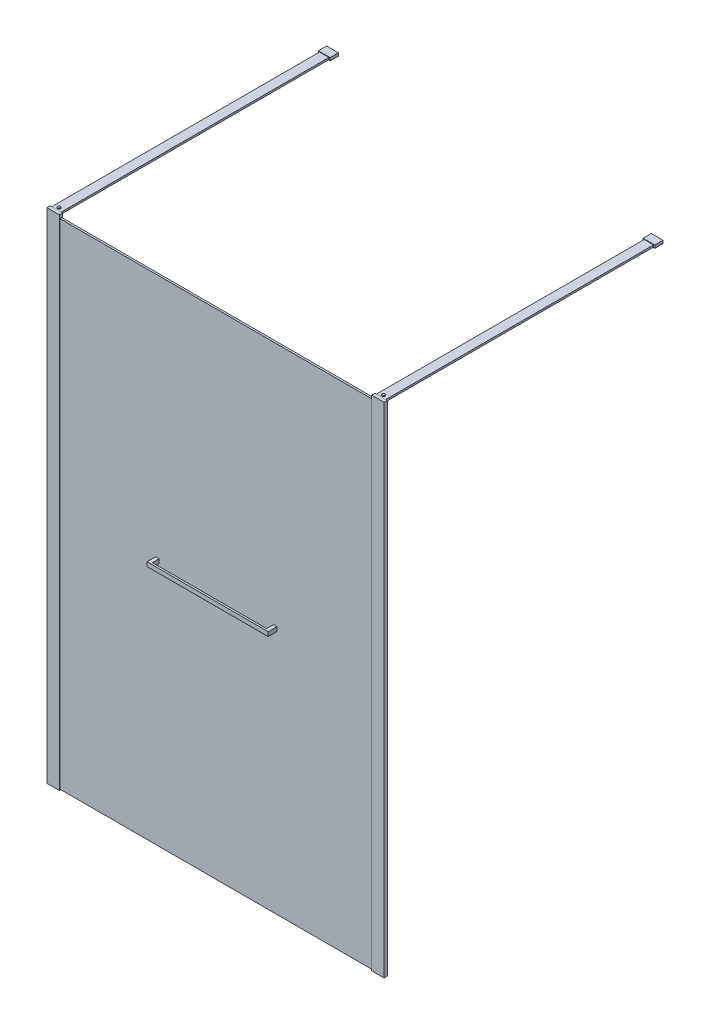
ISO-10303-21;
HEADER;
FILE_DESCRIPTION(('STEP AP214'),'2;1');
FILE_NAME('part.step','',(''),(''),'','','');
FILE_SCHEMA(('AUTOMOTIVE_DESIGN { 1 0 10303 214 1 1 1 1 }'));
ENDSEC;
DATA;
#1=APPLICATION_CONTEXT('core data for automotive mechanical design processes');
#2=APPLICATION_PROTOCOL_DEFINITION('international standard','automotive_design',2000,#1);
#3=PRODUCT_CONTEXT('',#1,'mechanical');
#4=PRODUCT('Part','Part','',(#3));
#5=PRODUCT_RELATED_PRODUCT_CATEGORY('part','',(#4));
#6=PRODUCT_DEFINITION_FORMATION('','',#4);
#7=PRODUCT_DEFINITION_CONTEXT('part definition',#1,'design');
#8=PRODUCT_DEFINITION('design','',#6,#7);
#9=PRODUCT_DEFINITION_SHAPE('','',#8);
#10=(LENGTH_UNIT() NAMED_UNIT(*) SI_UNIT(.MILLI.,.METRE.));
#11=(NAMED_UNIT(*) PLANE_ANGLE_UNIT() SI_UNIT($,.RADIAN.));
#12=(NAMED_UNIT(*) SI_UNIT($,.STERADIAN.) SOLID_ANGLE_UNIT());
#13=UNCERTAINTY_MEASURE_WITH_UNIT(LENGTH_MEASURE(1.E-05),#10,'distance_accuracy_value','');
#14=(GEOMETRIC_REPRESENTATION_CONTEXT(3) GLOBAL_UNCERTAINTY_ASSIGNED_CONTEXT((#13)) GLOBAL_UNIT_ASSIGNED_CONTEXT((#10,
#11,#12)) REPRESENTATION_CONTEXT('',''));
#15=CARTESIAN_POINT('',(0.,0.,0.));
#16=DIRECTION('',(0.,0.,1.));
#17=DIRECTION('',(1.,0.,0.));
#18=AXIS2_PLACEMENT_3D('',#15,#16,#17);
#19=CARTESIAN_POINT('',(473.9,1062.,-21.));
#20=DIRECTION('',(1.,0.,0.));
#21=DIRECTION('',(0.,0.,-1.));
#22=AXIS2_PLACEMENT_3D('',#19,#20,#21);
#23=PLANE('',#22);
#24=DIRECTION('',(0.,1.,0.));
#25=VECTOR('',#24,1.);
#26=CARTESIAN_POINT('',(473.9,1062.,25.5));
#27=LINE('',#26,#25);
#28=CARTESIAN_POINT('',(473.9,1044.,25.5));
#29=VERTEX_POINT('',#28);
#30=CARTESIAN_POINT('',(473.9,1062.,25.5));
#31=VERTEX_POINT('',#30);
#32=EDGE_CURVE('E63',#29,#31,#27,.T.);
#33=ORIENTED_EDGE('',*,*,#32,.F.);
#34=DIRECTION('',(0.,0.,1.));
#35=VECTOR('',#34,1.);
#36=CARTESIAN_POINT('',(473.9,1044.,-21.));
#37=LINE('',#36,#35);
#38=CARTESIAN_POINT('',(473.9,1044.,-21.));
#39=VERTEX_POINT('',#38);
#40=EDGE_CURVE('E12',#39,#29,#37,.T.);
#41=ORIENTED_EDGE('',*,*,#40,.F.);
#42=DIRECTION('',(0.,1.,0.));
#43=VECTOR('',#42,1.);
#44=CARTESIAN_POINT('',(473.9,1062.,-21.));
#45=LINE('',#44,#43);
#46=CARTESIAN_POINT('',(473.9,1062.,-21.));
#47=VERTEX_POINT('',#46);
#48=EDGE_CURVE('E193',#39,#47,#45,.T.);
#49=ORIENTED_EDGE('',*,*,#48,.T.);
#50=DIRECTION('',(0.,0.,1.));
#51=VECTOR('',#50,1.);
#52=CARTESIAN_POINT('',(473.9,1062.,-21.));
#53=LINE('',#52,#51);
#54=EDGE_CURVE('E176',#47,#31,#53,.T.);
#55=ORIENTED_EDGE('',*,*,#54,.T.);
#56=EDGE_LOOP('',(#33,#41,#49,#55));
#57=FACE_BOUND('',#56,.T.);
#58=ADVANCED_FACE('F46',(#57),#23,.T.);
#59=CARTESIAN_POINT('',(458.9,1044.,-21.));
#60=DIRECTION('',(0.,-1.,0.));
#61=DIRECTION('',(0.,0.,-1.));
#62=AXIS2_PLACEMENT_3D('',#59,#60,#61);
#63=PLANE('',#62);
#64=ORIENTED_EDGE('',*,*,#40,.T.);
#65=DIRECTION('',(-1.,0.,0.));
#66=VECTOR('',#65,1.);
#67=CARTESIAN_POINT('',(978.597715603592,1044.,25.5));
#68=LINE('',#67,#66);
#69=CARTESIAN_POINT('',(958.9,1044.,25.5));
#70=VERTEX_POINT('',#69);
#71=EDGE_CURVE('E166',#70,#29,#68,.T.);
#72=ORIENTED_EDGE('',*,*,#71,.F.);
#73=DIRECTION('',(0.,0.,1.));
#74=VECTOR('',#73,1.);
#75=CARTESIAN_POINT('',(958.9,1044.,-21.));
#76=LINE('',#75,#74);
#77=CARTESIAN_POINT('',(958.9,1044.,-21.));
#78=VERTEX_POINT('',#77);
#79=EDGE_CURVE('E149',#78,#70,#76,.T.);
#80=ORIENTED_EDGE('',*,*,#79,.F.);
#81=DIRECTION('',(1.,0.,0.));
#82=VECTOR('',#81,1.);
#83=CARTESIAN_POINT('',(958.9,1044.,-21.));
#84=LINE('',#83,#82);
#85=CARTESIAN_POINT('',(973.9,1044.,-21.));
#86=VERTEX_POINT('',#85);
#87=EDGE_CURVE('E131',#78,#86,#84,.T.);
#88=ORIENTED_EDGE('',*,*,#87,.T.);
#89=DIRECTION('',(0.,0.,1.));
#90=VECTOR('',#89,1.);
#91=CARTESIAN_POINT('',(973.9,1044.,-21.));
#92=LINE('',#91,#90);
#93=CARTESIAN_POINT('',(973.9,1044.,33.5));
#94=VERTEX_POINT('',#93);
#95=EDGE_CURVE('E147',#86,#94,#92,.T.);
#96=ORIENTED_EDGE('',*,*,#95,.T.);
#97=DIRECTION('',(1.,0.,0.));
#98=VECTOR('',#97,1.);
#99=CARTESIAN_POINT('',(458.9,1044.,33.5));
#100=LINE('',#99,#98);
#101=CARTESIAN_POINT('',(458.9,1044.,33.5));
#102=VERTEX_POINT('',#101);
#103=EDGE_CURVE('E135',#102,#94,#100,.T.);
#104=ORIENTED_EDGE('',*,*,#103,.F.);
#105=DIRECTION('',(0.,0.,1.));
#106=VECTOR('',#105,1.);
#107=CARTESIAN_POINT('',(458.9,1044.,-21.));
#108=LINE('',#107,#106);
#109=CARTESIAN_POINT('',(458.9,1044.,-21.));
#110=VERTEX_POINT('',#109);
#111=EDGE_CURVE('E55',#110,#102,#108,.T.);
#112=ORIENTED_EDGE('',*,*,#111,.F.);
#113=DIRECTION('',(1.,0.,0.));
#114=VECTOR('',#113,1.);
#115=CARTESIAN_POINT('',(458.9,1044.,-21.));
#116=LINE('',#115,#114);
#117=EDGE_CURVE('E181',#110,#39,#116,.T.);
#118=ORIENTED_EDGE('',*,*,#117,.T.);
#119=EDGE_LOOP('',(#64,#72,#80,#88,#96,#104,#112,#118));
#120=FACE_BOUND('',#119,.T.);
#121=ADVANCED_FACE('F197',(#120),#63,.T.);
#122=CARTESIAN_POINT('',(458.9,1062.,-21.));
#123=DIRECTION('',(-1.,0.,0.));
#124=DIRECTION('',(0.,0.,1.));
#125=AXIS2_PLACEMENT_3D('',#122,#123,#124);
#126=PLANE('',#125);
#127=ORIENTED_EDGE('',*,*,#111,.T.);
#128=DIRECTION('',(0.,-1.,0.));
#129=VECTOR('',#128,1.);
#130=CARTESIAN_POINT('',(458.9,1062.,33.5));
#131=LINE('',#130,#129);
#132=CARTESIAN_POINT('',(458.9,1062.,33.5));
#133=VERTEX_POINT('',#132);
#134=EDGE_CURVE('E121',#133,#102,#131,.T.);
#135=ORIENTED_EDGE('',*,*,#134,.F.);
#136=DIRECTION('',(0.,0.,1.));
#137=VECTOR('',#136,1.);
#138=CARTESIAN_POINT('',(458.9,1062.,-21.));
#139=LINE('',#138,#137);
#140=CARTESIAN_POINT('',(458.9,1062.,-21.));
#141=VERTEX_POINT('',#140);
#142=EDGE_CURVE('E116',#141,#133,#139,.T.);
#143=ORIENTED_EDGE('',*,*,#142,.F.);
#144=DIRECTION('',(0.,-1.,0.));
#145=VECTOR('',#144,1.);
#146=CARTESIAN_POINT('',(458.9,1062.,-21.));
#147=LINE('',#146,#145);
#148=EDGE_CURVE('E186',#141,#110,#147,.T.);
#149=ORIENTED_EDGE('',*,*,#148,.T.);
#150=EDGE_LOOP('',(#127,#135,#143,#149));
#151=FACE_BOUND('',#150,.T.);
#152=ADVANCED_FACE('F218',(#151),#126,.T.);
#153=CARTESIAN_POINT('',(458.9,1062.,-21.));
#154=DIRECTION('',(0.,1.,0.));
#155=DIRECTION('',(0.,0.,1.));
#156=AXIS2_PLACEMENT_3D('',#153,#154,#155);
#157=PLANE('',#156);
#158=ORIENTED_EDGE('',*,*,#142,.T.);
#159=DIRECTION('',(-1.,0.,0.));
#160=VECTOR('',#159,1.);
#161=CARTESIAN_POINT('',(458.9,1062.,33.5));
#162=LINE('',#161,#160);
#163=CARTESIAN_POINT('',(973.9,1062.,33.5));
#164=VERTEX_POINT('',#163);
#165=EDGE_CURVE('E109',#164,#133,#162,.T.);
#166=ORIENTED_EDGE('',*,*,#165,.F.);
#167=DIRECTION('',(0.,0.,1.));
#168=VECTOR('',#167,1.);
#169=CARTESIAN_POINT('',(973.9,1062.,-21.));
#170=LINE('',#169,#168);
#171=CARTESIAN_POINT('',(973.9,1062.,-21.));
#172=VERTEX_POINT('',#171);
#173=EDGE_CURVE('E113',#172,#164,#170,.T.);
#174=ORIENTED_EDGE('',*,*,#173,.F.);
#175=DIRECTION('',(-1.,0.,0.));
#176=VECTOR('',#175,1.);
#177=CARTESIAN_POINT('',(958.9,1062.,-21.));
#178=LINE('',#177,#176);
#179=CARTESIAN_POINT('',(958.9,1062.,-21.));
#180=VERTEX_POINT('',#179);
#181=EDGE_CURVE('E138',#172,#180,#178,.T.);
#182=ORIENTED_EDGE('',*,*,#181,.T.);
#183=DIRECTION('',(0.,0.,1.));
#184=VECTOR('',#183,1.);
#185=CARTESIAN_POINT('',(958.9,1062.,-21.));
#186=LINE('',#185,#184);
#187=CARTESIAN_POINT('',(958.9,1062.,25.5));
#188=VERTEX_POINT('',#187);
#189=EDGE_CURVE('E130',#180,#188,#186,.T.);
#190=ORIENTED_EDGE('',*,*,#189,.T.);
#191=DIRECTION('',(-1.,0.,0.));
#192=VECTOR('',#191,1.);
#193=CARTESIAN_POINT('',(978.597715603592,1062.,25.5));
#194=LINE('',#193,#192);
#195=EDGE_CURVE('E163',#188,#31,#194,.T.);
#196=ORIENTED_EDGE('',*,*,#195,.T.);
#197=ORIENTED_EDGE('',*,*,#54,.F.);
#198=DIRECTION('',(-1.,0.,0.));
#199=VECTOR('',#198,1.);
#200=CARTESIAN_POINT('',(458.9,1062.,-21.));
#201=LINE('',#200,#199);
#202=EDGE_CURVE('E190',#47,#141,#201,.T.);
#203=ORIENTED_EDGE('',*,*,#202,.T.);
#204=EDGE_LOOP('',(#158,#166,#174,#182,#190,#196,#197,#203));
#205=FACE_BOUND('',#204,.T.);
#206=ADVANCED_FACE('F111',(#205),#157,.T.);
#207=CARTESIAN_POINT('',(473.9,1044.,-21.));
#208=DIRECTION('',(0.,0.,1.));
#209=DIRECTION('',(1.,0.,0.));
#210=AXIS2_PLACEMENT_3D('',#207,#208,#209);
#211=PLANE('',#210);
#212=ORIENTED_EDGE('',*,*,#48,.F.);
#213=ORIENTED_EDGE('',*,*,#117,.F.);
#214=ORIENTED_EDGE('',*,*,#148,.F.);
#215=ORIENTED_EDGE('',*,*,#202,.F.);
#216=EDGE_LOOP('',(#212,#213,#214,#215));
#217=FACE_BOUND('',#216,.T.);
#218=ADVANCED_FACE('F225',(#217),#211,.F.);
#219=CARTESIAN_POINT('',(473.9,1044.,33.5));
#220=DIRECTION('',(0.,0.,1.));
#221=DIRECTION('',(1.,0.,0.));
#222=AXIS2_PLACEMENT_3D('',#219,#220,#221);
#223=PLANE('',#222);
#224=ORIENTED_EDGE('',*,*,#103,.T.);
#225=DIRECTION('',(0.,1.,0.));
#226=VECTOR('',#225,1.);
#227=CARTESIAN_POINT('',(973.9,1062.,33.5));
#228=LINE('',#227,#226);
#229=EDGE_CURVE('E127',#94,#164,#228,.T.);
#230=ORIENTED_EDGE('',*,*,#229,.T.);
#231=ORIENTED_EDGE('',*,*,#165,.T.);
#232=ORIENTED_EDGE('',*,*,#134,.T.);
#233=EDGE_LOOP('',(#224,#230,#231,#232));
#234=FACE_BOUND('',#233,.T.);
#235=ADVANCED_FACE('F133',(#234),#223,.T.);
#236=CARTESIAN_POINT('',(978.597715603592,1062.,25.5));
#237=DIRECTION('',(0.,0.,1.));
#238=DIRECTION('',(1.,0.,0.));
#239=AXIS2_PLACEMENT_3D('',#236,#237,#238);
#240=PLANE('',#239);
#241=ORIENTED_EDGE('',*,*,#195,.F.);
#242=DIRECTION('',(0.,-1.,0.));
#243=VECTOR('',#242,1.);
#244=CARTESIAN_POINT('',(958.9,1062.,25.5));
#245=LINE('',#244,#243);
#246=EDGE_CURVE('E49',#188,#70,#245,.T.);
#247=ORIENTED_EDGE('',*,*,#246,.T.);
#248=ORIENTED_EDGE('',*,*,#71,.T.);
#249=ORIENTED_EDGE('',*,*,#32,.T.);
#250=EDGE_LOOP('',(#241,#247,#248,#249));
#251=FACE_BOUND('',#250,.T.);
#252=ADVANCED_FACE('F203',(#251),#240,.F.);
#253=CARTESIAN_POINT('',(958.9,1062.,-21.));
#254=DIRECTION('',(-1.,0.,0.));
#255=DIRECTION('',(0.,0.,1.));
#256=AXIS2_PLACEMENT_3D('',#253,#254,#255);
#257=PLANE('',#256);
#258=ORIENTED_EDGE('',*,*,#246,.F.);
#259=ORIENTED_EDGE('',*,*,#189,.F.);
#260=DIRECTION('',(0.,-1.,0.));
#261=VECTOR('',#260,1.);
#262=CARTESIAN_POINT('',(958.9,1062.,-21.));
#263=LINE('',#262,#261);
#264=EDGE_CURVE('E142',#180,#78,#263,.T.);
#265=ORIENTED_EDGE('',*,*,#264,.T.);
#266=ORIENTED_EDGE('',*,*,#79,.T.);
#267=EDGE_LOOP('',(#258,#259,#265,#266));
#268=FACE_BOUND('',#267,.T.);
#269=ADVANCED_FACE('F204',(#268),#257,.T.);
#270=CARTESIAN_POINT('',(973.9,1062.,-21.));
#271=DIRECTION('',(1.,0.,0.));
#272=DIRECTION('',(0.,0.,-1.));
#273=AXIS2_PLACEMENT_3D('',#270,#271,#272);
#274=PLANE('',#273);
#275=ORIENTED_EDGE('',*,*,#173,.T.);
#276=ORIENTED_EDGE('',*,*,#229,.F.);
#277=ORIENTED_EDGE('',*,*,#95,.F.);
#278=DIRECTION('',(0.,1.,0.));
#279=VECTOR('',#278,1.);
#280=CARTESIAN_POINT('',(973.9,1062.,-21.));
#281=LINE('',#280,#279);
#282=EDGE_CURVE('E129',#86,#172,#281,.T.);
#283=ORIENTED_EDGE('',*,*,#282,.T.);
#284=EDGE_LOOP('',(#275,#276,#277,#283));
#285=FACE_BOUND('',#284,.T.);
#286=ADVANCED_FACE('F126',(#285),#274,.T.);
#287=CARTESIAN_POINT('',(973.9,1044.,-21.));
#288=DIRECTION('',(0.,0.,1.));
#289=DIRECTION('',(1.,0.,0.));
#290=AXIS2_PLACEMENT_3D('',#287,#288,#289);
#291=PLANE('',#290);
#292=ORIENTED_EDGE('',*,*,#282,.F.);
#293=ORIENTED_EDGE('',*,*,#87,.F.);
#294=ORIENTED_EDGE('',*,*,#264,.F.);
#295=ORIENTED_EDGE('',*,*,#181,.F.);
#296=EDGE_LOOP('',(#292,#293,#294,#295));
#297=FACE_BOUND('',#296,.T.);
#298=ADVANCED_FACE('F200',(#297),#291,.F.);
#299=CLOSED_SHELL('',(#58,#121,#152,#206,#218,#235,#252,#269,#286,#298));
#300=MANIFOLD_SOLID_BREP('B2',#299);
#301=CARTESIAN_POINT('',(46.5000000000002,2119.,-1184.));
#302=DIRECTION('',(-1.,0.,0.));
#303=DIRECTION('',(0.,0.,1.));
#304=AXIS2_PLACEMENT_3D('',#301,#302,#303);
#305=PLANE('',#304);
#306=DIRECTION('',(0.,-1.,0.));
#307=VECTOR('',#306,1.);
#308=CARTESIAN_POINT('',(46.5000000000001,2119.,-1152.));
#309=LINE('',#308,#307);
#310=CARTESIAN_POINT('',(46.5000000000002,2119.,-1152.));
#311=VERTEX_POINT('',#310);
#312=CARTESIAN_POINT('',(46.5000000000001,2111.,-1152.));
#313=VERTEX_POINT('',#312);
#314=EDGE_CURVE('E417',#311,#313,#309,.T.);
#315=ORIENTED_EDGE('',*,*,#314,.F.);
#316=DIRECTION('',(0.,0.,1.));
#317=VECTOR('',#316,1.);
#318=CARTESIAN_POINT('',(46.5000000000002,2119.,-1184.));
#319=LINE('',#318,#317);
#320=CARTESIAN_POINT('',(46.5,2119.,-14.));
#321=VERTEX_POINT('',#320);
#322=EDGE_CURVE('E432',#311,#321,#319,.T.);
#323=ORIENTED_EDGE('',*,*,#322,.T.);
#324=DIRECTION('',(0.,-1.,0.));
#325=VECTOR('',#324,1.);
#326=CARTESIAN_POINT('',(46.5,2119.,-14.));
#327=LINE('',#326,#325);
#328=CARTESIAN_POINT('',(46.5,2111.,-14.));
#329=VERTEX_POINT('',#328);
#330=EDGE_CURVE('E420',#321,#329,#327,.T.);
#331=ORIENTED_EDGE('',*,*,#330,.T.);
#332=DIRECTION('',(0.,0.,1.));
#333=VECTOR('',#332,1.);
#334=CARTESIAN_POINT('',(46.5000000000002,2111.,-1184.));
#335=LINE('',#334,#333);
#336=EDGE_CURVE('E327',#313,#329,#335,.T.);
#337=ORIENTED_EDGE('',*,*,#336,.F.);
#338=EDGE_LOOP('',(#315,#323,#331,#337));
#339=FACE_BOUND('',#338,.T.);
#340=ADVANCED_FACE('F319',(#339),#305,.F.);
#341=CARTESIAN_POINT('',(46.5000000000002,2111.,-1184.));
#342=DIRECTION('',(0.,1.,0.));
#343=DIRECTION('',(0.,0.,1.));
#344=AXIS2_PLACEMENT_3D('',#341,#342,#343);
#345=PLANE('',#344);
#346=DIRECTION('',(-1.,0.,0.));
#347=VECTOR('',#346,1.);
#348=CARTESIAN_POINT('',(46.5000000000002,2111.,-1152.));
#349=LINE('',#348,#347);
#350=CARTESIAN_POINT('',(6.50000000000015,2111.,-1152.));
#351=VERTEX_POINT('',#350);
#352=EDGE_CURVE('E334',#313,#351,#349,.T.);
#353=ORIENTED_EDGE('',*,*,#352,.F.);
#354=ORIENTED_EDGE('',*,*,#336,.T.);
#355=DIRECTION('',(-1.,0.,0.));
#356=VECTOR('',#355,1.);
#357=CARTESIAN_POINT('',(46.5,2111.,-14.));
#358=LINE('',#357,#356);
#359=CARTESIAN_POINT('',(6.5,2111.,-14.));
#360=VERTEX_POINT('',#359);
#361=EDGE_CURVE('E423',#329,#360,#358,.T.);
#362=ORIENTED_EDGE('',*,*,#361,.T.);
#363=DIRECTION('',(0.,0.,1.));
#364=VECTOR('',#363,1.);
#365=CARTESIAN_POINT('',(6.50000000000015,2111.,-1184.));
#366=LINE('',#365,#364);
#367=EDGE_CURVE('E436',#351,#360,#366,.T.);
#368=ORIENTED_EDGE('',*,*,#367,.F.);
#369=EDGE_LOOP('',(#353,#354,#362,#368));
#370=FACE_BOUND('',#369,.T.);
#371=ADVANCED_FACE('F438',(#370),#345,.F.);
#372=CARTESIAN_POINT('',(6.50000000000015,2119.,-1184.));
#373=DIRECTION('',(1.,0.,0.));
#374=DIRECTION('',(0.,0.,-1.));
#375=AXIS2_PLACEMENT_3D('',#372,#373,#374);
#376=PLANE('',#375);
#377=DIRECTION('',(0.,1.,0.));
#378=VECTOR('',#377,1.);
#379=CARTESIAN_POINT('',(6.50000000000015,2119.,-1152.));
#380=LINE('',#379,#378);
#381=CARTESIAN_POINT('',(6.50000000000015,2119.,-1152.));
#382=VERTEX_POINT('',#381);
#383=EDGE_CURVE('E342',#351,#382,#380,.T.);
#384=ORIENTED_EDGE('',*,*,#383,.F.);
#385=ORIENTED_EDGE('',*,*,#367,.T.);
#386=DIRECTION('',(0.,1.,0.));
#387=VECTOR('',#386,1.);
#388=CARTESIAN_POINT('',(6.5,2119.,-14.));
#389=LINE('',#388,#387);
#390=CARTESIAN_POINT('',(6.5,2119.,-14.));
#391=VERTEX_POINT('',#390);
#392=EDGE_CURVE('E426',#360,#391,#389,.T.);
#393=ORIENTED_EDGE('',*,*,#392,.T.);
#394=DIRECTION('',(0.,0.,1.));
#395=VECTOR('',#394,1.);
#396=CARTESIAN_POINT('',(6.50000000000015,2119.,-1184.));
#397=LINE('',#396,#395);
#398=EDGE_CURVE('E434',#382,#391,#397,.T.);
#399=ORIENTED_EDGE('',*,*,#398,.F.);
#400=EDGE_LOOP('',(#384,#385,#393,#399));
#401=FACE_BOUND('',#400,.T.);
#402=ADVANCED_FACE('F448',(#401),#376,.F.);
#403=CARTESIAN_POINT('',(46.5000000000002,2119.,-1184.));
#404=DIRECTION('',(0.,-1.,0.));
#405=DIRECTION('',(0.,0.,-1.));
#406=AXIS2_PLACEMENT_3D('',#403,#404,#405);
#407=PLANE('',#406);
#408=CARTESIAN_POINT('',(26.5,2119.,-24.));
#409=DIRECTION('',(0.,-1.,0.));
#410=DIRECTION('',(0.,0.,-1.));
#411=AXIS2_PLACEMENT_3D('',#408,#409,#410);
#412=CIRCLE('',#411,5.89999999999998);
#413=CARTESIAN_POINT('',(26.5,2119.,-29.9));
#414=VERTEX_POINT('',#413);
#415=EDGE_CURVE('E511',#414,#414,#412,.T.);
#416=ORIENTED_EDGE('',*,*,#415,.T.);
#417=EDGE_LOOP('',(#416));
#418=FACE_BOUND('',#417,.T.);
#419=DIRECTION('',(1.,0.,0.));
#420=VECTOR('',#419,1.);
#421=CARTESIAN_POINT('',(46.5000000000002,2119.,-1152.));
#422=LINE('',#421,#420);
#423=EDGE_CURVE('E44',#382,#311,#422,.T.);
#424=ORIENTED_EDGE('',*,*,#423,.F.);
#425=ORIENTED_EDGE('',*,*,#398,.T.);
#426=DIRECTION('',(1.,0.,0.));
#427=VECTOR('',#426,1.);
#428=CARTESIAN_POINT('',(46.5,2119.,-14.));
#429=LINE('',#428,#427);
#430=EDGE_CURVE('E429',#391,#321,#429,.T.);
#431=ORIENTED_EDGE('',*,*,#430,.T.);
#432=ORIENTED_EDGE('',*,*,#322,.F.);
#433=EDGE_LOOP('',(#424,#425,#431,#432));
#434=FACE_BOUND('',#433,.T.);
#435=ADVANCED_FACE('F447',(#418,#434),#407,.F.);
#436=CARTESIAN_POINT('',(46.5,2111.,-14.));
#437=DIRECTION('',(0.,0.,-1.));
#438=DIRECTION('',(-1.,0.,0.));
#439=AXIS2_PLACEMENT_3D('',#436,#437,#438);
#440=PLANE('',#439);
#441=ORIENTED_EDGE('',*,*,#330,.F.);
#442=ORIENTED_EDGE('',*,*,#430,.F.);
#443=ORIENTED_EDGE('',*,*,#392,.F.);
#444=ORIENTED_EDGE('',*,*,#361,.F.);
#445=EDGE_LOOP('',(#441,#442,#443,#444));
#446=FACE_BOUND('',#445,.T.);
#447=ADVANCED_FACE('F444',(#446),#440,.F.);
#448=CARTESIAN_POINT('',(1.50000000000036,2108.75,-1152.));
#449=DIRECTION('',(0.,0.,-1.));
#450=DIRECTION('',(-1.,0.,0.));
#451=AXIS2_PLACEMENT_3D('',#448,#449,#450);
#452=PLANE('',#451);
#453=DIRECTION('',(0.,1.,0.));
#454=VECTOR('',#453,1.);
#455=CARTESIAN_POINT('',(1.50000000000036,2121.25,-1152.));
#456=LINE('',#455,#454);
#457=CARTESIAN_POINT('',(1.50000000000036,2108.75,-1152.));
#458=VERTEX_POINT('',#457);
#459=CARTESIAN_POINT('',(1.50000000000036,2121.25,-1152.));
#460=VERTEX_POINT('',#459);
#461=EDGE_CURVE('E409',#458,#460,#456,.T.);
#462=ORIENTED_EDGE('',*,*,#461,.F.);
#463=DIRECTION('',(-1.,0.,0.));
#464=VECTOR('',#463,1.);
#465=CARTESIAN_POINT('',(51.5000000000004,2108.75,-1152.));
#466=LINE('',#465,#464);
#467=CARTESIAN_POINT('',(51.5000000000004,2108.75,-1152.));
#468=VERTEX_POINT('',#467);
#469=EDGE_CURVE('E405',#468,#458,#466,.T.);
#470=ORIENTED_EDGE('',*,*,#469,.F.);
#471=DIRECTION('',(0.,-1.,0.));
#472=VECTOR('',#471,1.);
#473=CARTESIAN_POINT('',(51.5000000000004,2121.25,-1152.));
#474=LINE('',#473,#472);
#475=CARTESIAN_POINT('',(51.5000000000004,2121.25,-1152.));
#476=VERTEX_POINT('',#475);
#477=EDGE_CURVE('E492',#476,#468,#474,.T.);
#478=ORIENTED_EDGE('',*,*,#477,.F.);
#479=DIRECTION('',(1.,0.,0.));
#480=VECTOR('',#479,1.);
#481=CARTESIAN_POINT('',(51.5000000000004,2121.25,-1152.));
#482=LINE('',#481,#480);
#483=EDGE_CURVE('E495',#460,#476,#482,.T.);
#484=ORIENTED_EDGE('',*,*,#483,.F.);
#485=EDGE_LOOP('',(#462,#470,#478,#484));
#486=FACE_BOUND('',#485,.T.);
#487=ORIENTED_EDGE('',*,*,#423,.T.);
#488=ORIENTED_EDGE('',*,*,#314,.T.);
#489=ORIENTED_EDGE('',*,*,#352,.T.);
#490=ORIENTED_EDGE('',*,*,#383,.T.);
#491=EDGE_LOOP('',(#487,#488,#489,#490));
#492=FACE_BOUND('',#491,.T.);
#493=ADVANCED_FACE('F450',(#486,#492),#452,.F.);
#494=CARTESIAN_POINT('',(1.50000000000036,2121.25,-1187.));
#495=DIRECTION('',(1.,0.,0.));
#496=DIRECTION('',(0.,0.,-1.));
#497=AXIS2_PLACEMENT_3D('',#494,#495,#496);
#498=PLANE('',#497);
#499=ORIENTED_EDGE('',*,*,#461,.T.);
#500=DIRECTION('',(0.,0.,1.));
#501=VECTOR('',#500,1.);
#502=CARTESIAN_POINT('',(1.50000000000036,2121.25,-1187.));
#503=LINE('',#502,#501);
#504=CARTESIAN_POINT('',(1.50000000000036,2121.25,-1187.));
#505=VERTEX_POINT('',#504);
#506=EDGE_CURVE('E389',#505,#460,#503,.T.);
#507=ORIENTED_EDGE('',*,*,#506,.F.);
#508=DIRECTION('',(0.,1.,0.));
#509=VECTOR('',#508,1.);
#510=CARTESIAN_POINT('',(1.50000000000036,2121.25,-1187.));
#511=LINE('',#510,#509);
#512=CARTESIAN_POINT('',(1.50000000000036,2108.75,-1187.));
#513=VERTEX_POINT('',#512);
#514=EDGE_CURVE('E396',#513,#505,#511,.T.);
#515=ORIENTED_EDGE('',*,*,#514,.F.);
#516=DIRECTION('',(0.,0.,1.));
#517=VECTOR('',#516,1.);
#518=CARTESIAN_POINT('',(1.50000000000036,2108.75,-1187.));
#519=LINE('',#518,#517);
#520=EDGE_CURVE('E489',#513,#458,#519,.T.);
#521=ORIENTED_EDGE('',*,*,#520,.T.);
#522=EDGE_LOOP('',(#499,#507,#515,#521));
#523=FACE_BOUND('',#522,.T.);
#524=ADVANCED_FACE('F407',(#523),#498,.F.);
#525=CARTESIAN_POINT('',(51.5000000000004,2121.25,-1187.));
#526=DIRECTION('',(0.,-1.,0.));
#527=DIRECTION('',(0.,0.,-1.));
#528=AXIS2_PLACEMENT_3D('',#525,#526,#527);
#529=PLANE('',#528);
#530=ORIENTED_EDGE('',*,*,#483,.T.);
#531=DIRECTION('',(0.,0.,1.));
#532=VECTOR('',#531,1.);
#533=CARTESIAN_POINT('',(51.5000000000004,2121.25,-1187.));
#534=LINE('',#533,#532);
#535=CARTESIAN_POINT('',(51.5000000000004,2121.25,-1187.));
#536=VERTEX_POINT('',#535);
#537=EDGE_CURVE('E392',#536,#476,#534,.T.);
#538=ORIENTED_EDGE('',*,*,#537,.F.);
#539=DIRECTION('',(1.,0.,0.));
#540=VECTOR('',#539,1.);
#541=CARTESIAN_POINT('',(51.5000000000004,2121.25,-1187.));
#542=LINE('',#541,#540);
#543=EDGE_CURVE('E385',#505,#536,#542,.T.);
#544=ORIENTED_EDGE('',*,*,#543,.F.);
#545=ORIENTED_EDGE('',*,*,#506,.T.);
#546=EDGE_LOOP('',(#530,#538,#544,#545));
#547=FACE_BOUND('',#546,.T.);
#548=ADVANCED_FACE('F387',(#547),#529,.F.);
#549=CARTESIAN_POINT('',(51.5000000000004,2121.25,-1187.));
#550=DIRECTION('',(-1.,0.,0.));
#551=DIRECTION('',(0.,0.,1.));
#552=AXIS2_PLACEMENT_3D('',#549,#550,#551);
#553=PLANE('',#552);
#554=ORIENTED_EDGE('',*,*,#477,.T.);
#555=DIRECTION('',(0.,0.,1.));
#556=VECTOR('',#555,1.);
#557=CARTESIAN_POINT('',(51.5000000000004,2108.75,-1187.));
#558=LINE('',#557,#556);
#559=CARTESIAN_POINT('',(51.5000000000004,2108.75,-1187.));
#560=VERTEX_POINT('',#559);
#561=EDGE_CURVE('E412',#560,#468,#558,.T.);
#562=ORIENTED_EDGE('',*,*,#561,.F.);
#563=DIRECTION('',(0.,-1.,0.));
#564=VECTOR('',#563,1.);
#565=CARTESIAN_POINT('',(51.5000000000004,2121.25,-1187.));
#566=LINE('',#565,#564);
#567=EDGE_CURVE('E395',#536,#560,#566,.T.);
#568=ORIENTED_EDGE('',*,*,#567,.F.);
#569=ORIENTED_EDGE('',*,*,#537,.T.);
#570=EDGE_LOOP('',(#554,#562,#568,#569));
#571=FACE_BOUND('',#570,.T.);
#572=ADVANCED_FACE('F477',(#571),#553,.F.);
#573=CARTESIAN_POINT('',(51.5000000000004,2108.75,-1187.));
#574=DIRECTION('',(0.,1.,0.));
#575=DIRECTION('',(0.,0.,1.));
#576=AXIS2_PLACEMENT_3D('',#573,#574,#575);
#577=PLANE('',#576);
#578=ORIENTED_EDGE('',*,*,#469,.T.);
#579=ORIENTED_EDGE('',*,*,#520,.F.);
#580=DIRECTION('',(-1.,0.,0.));
#581=VECTOR('',#580,1.);
#582=CARTESIAN_POINT('',(51.5000000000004,2108.75,-1187.));
#583=LINE('',#582,#581);
#584=EDGE_CURVE('E401',#560,#513,#583,.T.);
#585=ORIENTED_EDGE('',*,*,#584,.F.);
#586=ORIENTED_EDGE('',*,*,#561,.T.);
#587=EDGE_LOOP('',(#578,#579,#585,#586));
#588=FACE_BOUND('',#587,.T.);
#589=ADVANCED_FACE('F479',(#588),#577,.F.);
#590=CARTESIAN_POINT('',(1.50000000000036,2108.75,-1187.));
#591=DIRECTION('',(0.,0.,-1.));
#592=DIRECTION('',(-1.,0.,0.));
#593=AXIS2_PLACEMENT_3D('',#590,#591,#592);
#594=PLANE('',#593);
#595=ORIENTED_EDGE('',*,*,#514,.T.);
#596=ORIENTED_EDGE('',*,*,#543,.T.);
#597=ORIENTED_EDGE('',*,*,#567,.T.);
#598=ORIENTED_EDGE('',*,*,#584,.T.);
#599=EDGE_LOOP('',(#595,#596,#597,#598));
#600=FACE_BOUND('',#599,.T.);
#601=ADVANCED_FACE('F399',(#600),#594,.T.);
#602=CARTESIAN_POINT('',(26.5,2115.34934210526,-24.));
#603=DIRECTION('',(0.,-1.,0.));
#604=DIRECTION('',(0.,0.,-1.));
#605=AXIS2_PLACEMENT_3D('',#602,#603,#604);
#606=SPHERICAL_SURFACE('',#605,9.35065789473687);
#607=CARTESIAN_POINT('',(26.5,2122.8,-24.));
#608=DIRECTION('',(0.,-1.,0.));
#609=DIRECTION('',(0.,0.,-1.));
#610=AXIS2_PLACEMENT_3D('',#607,#608,#609);
#611=CIRCLE('',#610,5.64999999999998);
#612=CARTESIAN_POINT('',(26.5,2122.8,-29.65));
#613=VERTEX_POINT('',#612);
#614=EDGE_CURVE('E508',#613,#613,#611,.T.);
#615=ORIENTED_EDGE('',*,*,#614,.F.);
#616=EDGE_LOOP('',(#615));
#617=FACE_BOUND('',#616,.T.);
#618=ADVANCED_FACE('F486',(#617),#606,.T.);
#619=CARTESIAN_POINT('',(26.5,2119.,-24.));
#620=DIRECTION('',(0.,-1.,0.));
#621=DIRECTION('',(0.,0.,-1.));
#622=AXIS2_PLACEMENT_3D('',#619,#620,#621);
#623=CONICAL_SURFACE('',#622,5.89999999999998,0.0656948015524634);
#624=ORIENTED_EDGE('',*,*,#614,.T.);
#625=EDGE_LOOP('',(#624));
#626=FACE_BOUND('',#625,.T.);
#627=ORIENTED_EDGE('',*,*,#415,.F.);
#628=EDGE_LOOP('',(#627));
#629=FACE_BOUND('',#628,.T.);
#630=ADVANCED_FACE('F515',(#626,#629),#623,.T.);
#631=CLOSED_SHELL('',(#340,#371,#402,#435,#447,#493,#524,#548,#572,#589,#601,#618,#630));
#632=CARTESIAN_POINT('',(26.5,2122.53567623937,-24.));
#633=DIRECTION('',(0.,-1.,0.));
#634=DIRECTION('',(0.,0.,-1.));
#635=AXIS2_PLACEMENT_3D('',#632,#633,#634);
#636=CONICAL_SURFACE('',#635,5.16630882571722,0.065694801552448);
#637=CARTESIAN_POINT('',(26.5,2119.,-24.));
#638=DIRECTION('',(0.,-1.,0.));
#639=DIRECTION('',(0.,0.,-1.));
#640=AXIS2_PLACEMENT_3D('',#637,#638,#639);
#641=CIRCLE('',#640,5.39891910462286);
#642=CARTESIAN_POINT('',(26.5,2119.,-29.3989191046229));
#643=VERTEX_POINT('',#642);
#644=EDGE_CURVE('E496',#643,#643,#641,.T.);
#645=ORIENTED_EDGE('',*,*,#644,.T.);
#646=EDGE_LOOP('',(#645));
#647=FACE_BOUND('',#646,.T.);
#648=CARTESIAN_POINT('',(26.5,2122.53567623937,-24.));
#649=DIRECTION('',(0.,-1.,0.));
#650=DIRECTION('',(0.,0.,-1.));
#651=AXIS2_PLACEMENT_3D('',#648,#649,#650);
#652=CIRCLE('',#651,5.16630882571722);
#653=CARTESIAN_POINT('',(26.5,2122.53567623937,-29.1663088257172));
#654=VERTEX_POINT('',#653);
#655=EDGE_CURVE('E500',#654,#654,#652,.T.);
#656=ORIENTED_EDGE('',*,*,#655,.F.);
#657=EDGE_LOOP('',(#656));
#658=FACE_BOUND('',#657,.T.);
#659=ADVANCED_FACE('F529',(#647,#658),#636,.F.);
#660=CARTESIAN_POINT('',(26.5,2115.34934210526,-24.));
#661=DIRECTION('',(0.,-1.,0.));
#662=DIRECTION('',(0.,0.,-1.));
#663=AXIS2_PLACEMENT_3D('',#660,#661,#662);
#664=SPHERICAL_SURFACE('',#663,8.85065789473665);
#665=ORIENTED_EDGE('',*,*,#655,.T.);
#666=EDGE_LOOP('',(#665));
#667=FACE_BOUND('',#666,.T.);
#668=ADVANCED_FACE('F526',(#667),#664,.F.);
#669=ORIENTED_EDGE('',*,*,#644,.F.);
#670=EDGE_LOOP('',(#669));
#671=FACE_BOUND('',#670,.T.);
#672=ADVANCED_FACE('F473',(#671),#407,.F.);
#673=CLOSED_SHELL('',(#659,#668,#672));
#674=ORIENTED_CLOSED_SHELL('',*,#673,.T.);
#675=BREP_WITH_VOIDS('B6',#631,(#674));
#676=CARTESIAN_POINT('',(1426.3,2119.,-1184.));
#677=DIRECTION('',(0.,-1.,0.));
#678=DIRECTION('',(0.,0.,-1.));
#679=AXIS2_PLACEMENT_3D('',#676,#677,#678);
#680=PLANE('',#679);
#681=CARTESIAN_POINT('',(1406.3,2119.,-23.9999999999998));
#682=DIRECTION('',(0.,-1.,0.));
#683=DIRECTION('',(0.,0.,-1.));
#684=AXIS2_PLACEMENT_3D('',#681,#682,#683);
#685=CIRCLE('',#684,5.89999999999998);
#686=CARTESIAN_POINT('',(1406.3,2119.,-29.8999999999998));
#687=VERTEX_POINT('',#686);
#688=EDGE_CURVE('E814',#687,#687,#685,.T.);
#689=ORIENTED_EDGE('',*,*,#688,.T.);
#690=EDGE_LOOP('',(#689));
#691=FACE_BOUND('',#690,.T.);
#692=DIRECTION('',(1.,0.,0.));
#693=VECTOR('',#692,1.);
#694=CARTESIAN_POINT('',(1426.3,2119.,-1152.));
#695=LINE('',#694,#693);
#696=CARTESIAN_POINT('',(1386.3,2119.,-1152.));
#697=VERTEX_POINT('',#696);
#698=CARTESIAN_POINT('',(1426.3,2119.,-1152.));
#699=VERTEX_POINT('',#698);
#700=EDGE_CURVE('E316',#697,#699,#695,.T.);
#701=ORIENTED_EDGE('',*,*,#700,.F.);
#702=DIRECTION('',(0.,0.,1.));
#703=VECTOR('',#702,1.);
#704=CARTESIAN_POINT('',(1386.3,2119.,-1184.));
#705=LINE('',#704,#703);
#706=CARTESIAN_POINT('',(1386.3,2119.,-13.9999999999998));
#707=VERTEX_POINT('',#706);
#708=EDGE_CURVE('E755',#697,#707,#705,.T.);
#709=ORIENTED_EDGE('',*,*,#708,.T.);
#710=DIRECTION('',(1.,0.,0.));
#711=VECTOR('',#710,1.);
#712=CARTESIAN_POINT('',(1426.3,2119.,-13.9999999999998));
#713=LINE('',#712,#711);
#714=CARTESIAN_POINT('',(1426.3,2119.,-13.9999999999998));
#715=VERTEX_POINT('',#714);
#716=EDGE_CURVE('E750',#707,#715,#713,.T.);
#717=ORIENTED_EDGE('',*,*,#716,.T.);
#718=DIRECTION('',(0.,0.,1.));
#719=VECTOR('',#718,1.);
#720=CARTESIAN_POINT('',(1426.3,2119.,-1184.));
#721=LINE('',#720,#719);
#722=EDGE_CURVE('E753',#699,#715,#721,.T.);
#723=ORIENTED_EDGE('',*,*,#722,.F.);
#724=EDGE_LOOP('',(#701,#709,#717,#723));
#725=FACE_BOUND('',#724,.T.);
#726=ADVANCED_FACE('F639',(#691,#725),#680,.F.);
#727=CARTESIAN_POINT('',(1426.3,2119.,-1184.));
#728=DIRECTION('',(-1.,0.,0.));
#729=DIRECTION('',(0.,0.,1.));
#730=AXIS2_PLACEMENT_3D('',#727,#728,#729);
#731=PLANE('',#730);
#732=DIRECTION('',(0.,-1.,0.));
#733=VECTOR('',#732,1.);
#734=CARTESIAN_POINT('',(1426.3,2119.,-1152.));
#735=LINE('',#734,#733);
#736=CARTESIAN_POINT('',(1426.3,2111.,-1152.));
#737=VERTEX_POINT('',#736);
#738=EDGE_CURVE('E738',#699,#737,#735,.T.);
#739=ORIENTED_EDGE('',*,*,#738,.F.);
#740=ORIENTED_EDGE('',*,*,#722,.T.);
#741=DIRECTION('',(0.,-1.,0.));
#742=VECTOR('',#741,1.);
#743=CARTESIAN_POINT('',(1426.3,2119.,-13.9999999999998));
#744=LINE('',#743,#742);
#745=CARTESIAN_POINT('',(1426.3,2111.,-13.9999999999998));
#746=VERTEX_POINT('',#745);
#747=EDGE_CURVE('E741',#715,#746,#744,.T.);
#748=ORIENTED_EDGE('',*,*,#747,.T.);
#749=DIRECTION('',(0.,0.,1.));
#750=VECTOR('',#749,1.);
#751=CARTESIAN_POINT('',(1426.3,2111.,-1184.));
#752=LINE('',#751,#750);
#753=EDGE_CURVE('E648',#737,#746,#752,.T.);
#754=ORIENTED_EDGE('',*,*,#753,.F.);
#755=EDGE_LOOP('',(#739,#740,#748,#754));
#756=FACE_BOUND('',#755,.T.);
#757=ADVANCED_FACE('F641',(#756),#731,.F.);
#758=CARTESIAN_POINT('',(1426.3,2111.,-1184.));
#759=DIRECTION('',(0.,1.,0.));
#760=DIRECTION('',(0.,0.,1.));
#761=AXIS2_PLACEMENT_3D('',#758,#759,#760);
#762=PLANE('',#761);
#763=DIRECTION('',(-1.,0.,0.));
#764=VECTOR('',#763,1.);
#765=CARTESIAN_POINT('',(1426.3,2111.,-1152.));
#766=LINE('',#765,#764);
#767=CARTESIAN_POINT('',(1386.3,2111.,-1152.));
#768=VERTEX_POINT('',#767);
#769=EDGE_CURVE('E655',#737,#768,#766,.T.);
#770=ORIENTED_EDGE('',*,*,#769,.F.);
#771=ORIENTED_EDGE('',*,*,#753,.T.);
#772=DIRECTION('',(-1.,0.,0.));
#773=VECTOR('',#772,1.);
#774=CARTESIAN_POINT('',(1426.3,2111.,-13.9999999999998));
#775=LINE('',#774,#773);
#776=CARTESIAN_POINT('',(1386.3,2111.,-13.9999999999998));
#777=VERTEX_POINT('',#776);
#778=EDGE_CURVE('E744',#746,#777,#775,.T.);
#779=ORIENTED_EDGE('',*,*,#778,.T.);
#780=DIRECTION('',(0.,0.,1.));
#781=VECTOR('',#780,1.);
#782=CARTESIAN_POINT('',(1386.3,2111.,-1184.));
#783=LINE('',#782,#781);
#784=EDGE_CURVE('E757',#768,#777,#783,.T.);
#785=ORIENTED_EDGE('',*,*,#784,.F.);
#786=EDGE_LOOP('',(#770,#771,#779,#785));
#787=FACE_BOUND('',#786,.T.);
#788=ADVANCED_FACE('F759',(#787),#762,.F.);
#789=CARTESIAN_POINT('',(1386.3,2119.,-1184.));
#790=DIRECTION('',(1.,0.,0.));
#791=DIRECTION('',(0.,0.,-1.));
#792=AXIS2_PLACEMENT_3D('',#789,#790,#791);
#793=PLANE('',#792);
#794=DIRECTION('',(0.,1.,0.));
#795=VECTOR('',#794,1.);
#796=CARTESIAN_POINT('',(1386.3,2119.,-1152.));
#797=LINE('',#796,#795);
#798=EDGE_CURVE('E663',#768,#697,#797,.T.);
#799=ORIENTED_EDGE('',*,*,#798,.F.);
#800=ORIENTED_EDGE('',*,*,#784,.T.);
#801=DIRECTION('',(0.,1.,0.));
#802=VECTOR('',#801,1.);
#803=CARTESIAN_POINT('',(1386.3,2119.,-13.9999999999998));
#804=LINE('',#803,#802);
#805=EDGE_CURVE('E747',#777,#707,#804,.T.);
#806=ORIENTED_EDGE('',*,*,#805,.T.);
#807=ORIENTED_EDGE('',*,*,#708,.F.);
#808=EDGE_LOOP('',(#799,#800,#806,#807));
#809=FACE_BOUND('',#808,.T.);
#810=ADVANCED_FACE('F768',(#809),#793,.F.);
#811=CARTESIAN_POINT('',(1426.3,2111.,-13.9999999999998));
#812=DIRECTION('',(0.,0.,-1.));
#813=DIRECTION('',(-1.,0.,0.));
#814=AXIS2_PLACEMENT_3D('',#811,#812,#813);
#815=PLANE('',#814);
#816=ORIENTED_EDGE('',*,*,#747,.F.);
#817=ORIENTED_EDGE('',*,*,#716,.F.);
#818=ORIENTED_EDGE('',*,*,#805,.F.);
#819=ORIENTED_EDGE('',*,*,#778,.F.);
#820=EDGE_LOOP('',(#816,#817,#818,#819));
#821=FACE_BOUND('',#820,.T.);
#822=ADVANCED_FACE('F765',(#821),#815,.F.);
#823=CARTESIAN_POINT('',(1381.3,2108.75,-1152.));
#824=DIRECTION('',(0.,0.,-1.));
#825=DIRECTION('',(-1.,0.,0.));
#826=AXIS2_PLACEMENT_3D('',#823,#824,#825);
#827=PLANE('',#826);
#828=DIRECTION('',(0.,1.,0.));
#829=VECTOR('',#828,1.);
#830=CARTESIAN_POINT('',(1381.3,2121.25,-1152.));
#831=LINE('',#830,#829);
#832=CARTESIAN_POINT('',(1381.3,2108.75,-1152.));
#833=VERTEX_POINT('',#832);
#834=CARTESIAN_POINT('',(1381.3,2121.25,-1152.));
#835=VERTEX_POINT('',#834);
#836=EDGE_CURVE('E730',#833,#835,#831,.T.);
#837=ORIENTED_EDGE('',*,*,#836,.F.);
#838=DIRECTION('',(-1.,0.,0.));
#839=VECTOR('',#838,1.);
#840=CARTESIAN_POINT('',(1431.3,2108.75,-1152.));
#841=LINE('',#840,#839);
#842=CARTESIAN_POINT('',(1431.3,2108.75,-1152.));
#843=VERTEX_POINT('',#842);
#844=EDGE_CURVE('E726',#843,#833,#841,.T.);
#845=ORIENTED_EDGE('',*,*,#844,.F.);
#846=DIRECTION('',(0.,-1.,0.));
#847=VECTOR('',#846,1.);
#848=CARTESIAN_POINT('',(1431.3,2121.25,-1152.));
#849=LINE('',#848,#847);
#850=CARTESIAN_POINT('',(1431.3,2121.25,-1152.));
#851=VERTEX_POINT('',#850);
#852=EDGE_CURVE('E822',#851,#843,#849,.T.);
#853=ORIENTED_EDGE('',*,*,#852,.F.);
#854=DIRECTION('',(1.,0.,0.));
#855=VECTOR('',#854,1.);
#856=CARTESIAN_POINT('',(1431.3,2121.25,-1152.));
#857=LINE('',#856,#855);
#858=EDGE_CURVE('E820',#835,#851,#857,.T.);
#859=ORIENTED_EDGE('',*,*,#858,.F.);
#860=EDGE_LOOP('',(#837,#845,#853,#859));
#861=FACE_BOUND('',#860,.T.);
#862=ORIENTED_EDGE('',*,*,#700,.T.);
#863=ORIENTED_EDGE('',*,*,#738,.T.);
#864=ORIENTED_EDGE('',*,*,#769,.T.);
#865=ORIENTED_EDGE('',*,*,#798,.T.);
#866=EDGE_LOOP('',(#862,#863,#864,#865));
#867=FACE_BOUND('',#866,.T.);
#868=ADVANCED_FACE('F770',(#861,#867),#827,.F.);
#869=CARTESIAN_POINT('',(1381.3,2121.25,-1187.));
#870=DIRECTION('',(1.,0.,0.));
#871=DIRECTION('',(0.,0.,-1.));
#872=AXIS2_PLACEMENT_3D('',#869,#870,#871);
#873=PLANE('',#872);
#874=ORIENTED_EDGE('',*,*,#836,.T.);
#875=DIRECTION('',(0.,0.,1.));
#876=VECTOR('',#875,1.);
#877=CARTESIAN_POINT('',(1381.3,2121.25,-1187.));
#878=LINE('',#877,#876);
#879=CARTESIAN_POINT('',(1381.3,2121.25,-1187.));
#880=VERTEX_POINT('',#879);
#881=EDGE_CURVE('E710',#880,#835,#878,.T.);
#882=ORIENTED_EDGE('',*,*,#881,.F.);
#883=DIRECTION('',(0.,1.,0.));
#884=VECTOR('',#883,1.);
#885=CARTESIAN_POINT('',(1381.3,2121.25,-1187.));
#886=LINE('',#885,#884);
#887=CARTESIAN_POINT('',(1381.3,2108.75,-1187.));
#888=VERTEX_POINT('',#887);
#889=EDGE_CURVE('E717',#888,#880,#886,.T.);
#890=ORIENTED_EDGE('',*,*,#889,.F.);
#891=DIRECTION('',(0.,0.,1.));
#892=VECTOR('',#891,1.);
#893=CARTESIAN_POINT('',(1381.3,2108.75,-1187.));
#894=LINE('',#893,#892);
#895=EDGE_CURVE('E818',#888,#833,#894,.T.);
#896=ORIENTED_EDGE('',*,*,#895,.T.);
#897=EDGE_LOOP('',(#874,#882,#890,#896));
#898=FACE_BOUND('',#897,.T.);
#899=ADVANCED_FACE('F728',(#898),#873,.F.);
#900=CARTESIAN_POINT('',(1431.3,2121.25,-1187.));
#901=DIRECTION('',(0.,-1.,0.));
#902=DIRECTION('',(0.,0.,-1.));
#903=AXIS2_PLACEMENT_3D('',#900,#901,#902);
#904=PLANE('',#903);
#905=ORIENTED_EDGE('',*,*,#858,.T.);
#906=DIRECTION('',(0.,0.,1.));
#907=VECTOR('',#906,1.);
#908=CARTESIAN_POINT('',(1431.3,2121.25,-1187.));
#909=LINE('',#908,#907);
#910=CARTESIAN_POINT('',(1431.3,2121.25,-1187.));
#911=VERTEX_POINT('',#910);
#912=EDGE_CURVE('E713',#911,#851,#909,.T.);
#913=ORIENTED_EDGE('',*,*,#912,.F.);
#914=DIRECTION('',(1.,0.,0.));
#915=VECTOR('',#914,1.);
#916=CARTESIAN_POINT('',(1431.3,2121.25,-1187.));
#917=LINE('',#916,#915);
#918=EDGE_CURVE('E706',#880,#911,#917,.T.);
#919=ORIENTED_EDGE('',*,*,#918,.F.);
#920=ORIENTED_EDGE('',*,*,#881,.T.);
#921=EDGE_LOOP('',(#905,#913,#919,#920));
#922=FACE_BOUND('',#921,.T.);
#923=ADVANCED_FACE('F708',(#922),#904,.F.);
#924=CARTESIAN_POINT('',(1431.3,2121.25,-1187.));
#925=DIRECTION('',(-1.,0.,0.));
#926=DIRECTION('',(0.,0.,1.));
#927=AXIS2_PLACEMENT_3D('',#924,#925,#926);
#928=PLANE('',#927);
#929=ORIENTED_EDGE('',*,*,#852,.T.);
#930=DIRECTION('',(0.,0.,1.));
#931=VECTOR('',#930,1.);
#932=CARTESIAN_POINT('',(1431.3,2108.75,-1187.));
#933=LINE('',#932,#931);
#934=CARTESIAN_POINT('',(1431.3,2108.75,-1187.));
#935=VERTEX_POINT('',#934);
#936=EDGE_CURVE('E733',#935,#843,#933,.T.);
#937=ORIENTED_EDGE('',*,*,#936,.F.);
#938=DIRECTION('',(0.,-1.,0.));
#939=VECTOR('',#938,1.);
#940=CARTESIAN_POINT('',(1431.3,2121.25,-1187.));
#941=LINE('',#940,#939);
#942=EDGE_CURVE('E716',#911,#935,#941,.T.);
#943=ORIENTED_EDGE('',*,*,#942,.F.);
#944=ORIENTED_EDGE('',*,*,#912,.T.);
#945=EDGE_LOOP('',(#929,#937,#943,#944));
#946=FACE_BOUND('',#945,.T.);
#947=ADVANCED_FACE('F832',(#946),#928,.F.);
#948=CARTESIAN_POINT('',(1431.3,2108.75,-1187.));
#949=DIRECTION('',(0.,1.,0.));
#950=DIRECTION('',(0.,0.,1.));
#951=AXIS2_PLACEMENT_3D('',#948,#949,#950);
#952=PLANE('',#951);
#953=ORIENTED_EDGE('',*,*,#844,.T.);
#954=ORIENTED_EDGE('',*,*,#895,.F.);
#955=DIRECTION('',(-1.,0.,0.));
#956=VECTOR('',#955,1.);
#957=CARTESIAN_POINT('',(1431.3,2108.75,-1187.));
#958=LINE('',#957,#956);
#959=EDGE_CURVE('E722',#935,#888,#958,.T.);
#960=ORIENTED_EDGE('',*,*,#959,.F.);
#961=ORIENTED_EDGE('',*,*,#936,.T.);
#962=EDGE_LOOP('',(#953,#954,#960,#961));
#963=FACE_BOUND('',#962,.T.);
#964=ADVANCED_FACE('F829',(#963),#952,.F.);
#965=CARTESIAN_POINT('',(1381.3,2108.75,-1187.));
#966=DIRECTION('',(0.,0.,-1.));
#967=DIRECTION('',(-1.,0.,0.));
#968=AXIS2_PLACEMENT_3D('',#965,#966,#967);
#969=PLANE('',#968);
#970=ORIENTED_EDGE('',*,*,#889,.T.);
#971=ORIENTED_EDGE('',*,*,#918,.T.);
#972=ORIENTED_EDGE('',*,*,#942,.T.);
#973=ORIENTED_EDGE('',*,*,#959,.T.);
#974=EDGE_LOOP('',(#970,#971,#972,#973));
#975=FACE_BOUND('',#974,.T.);
#976=ADVANCED_FACE('F720',(#975),#969,.T.);
#977=CARTESIAN_POINT('',(1406.3,2119.,-23.9999999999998));
#978=DIRECTION('',(0.,-1.,0.));
#979=DIRECTION('',(0.,0.,-1.));
#980=AXIS2_PLACEMENT_3D('',#977,#978,#979);
#981=CONICAL_SURFACE('',#980,5.89999999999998,0.0656948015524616);
#982=CARTESIAN_POINT('',(1406.3,2122.8,-23.9999999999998));
#983=DIRECTION('',(0.,-1.,0.));
#984=DIRECTION('',(0.,0.,-1.));
#985=AXIS2_PLACEMENT_3D('',#982,#983,#984);
#986=CIRCLE('',#985,5.64999999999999);
#987=CARTESIAN_POINT('',(1406.3,2122.8,-29.6499999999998));
#988=VERTEX_POINT('',#987);
#989=EDGE_CURVE('E809',#988,#988,#986,.T.);
#990=ORIENTED_EDGE('',*,*,#989,.T.);
#991=EDGE_LOOP('',(#990));
#992=FACE_BOUND('',#991,.T.);
#993=ORIENTED_EDGE('',*,*,#688,.F.);
#994=EDGE_LOOP('',(#993));
#995=FACE_BOUND('',#994,.T.);
#996=ADVANCED_FACE('F906',(#992,#995),#981,.T.);
#997=CARTESIAN_POINT('',(1406.3,2115.34934210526,-23.9999999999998));
#998=DIRECTION('',(0.,-1.,0.));
#999=DIRECTION('',(0.,0.,-1.));
#1000=AXIS2_PLACEMENT_3D('',#997,#998,#999);
#1001=SPHERICAL_SURFACE('',#1000,9.35065789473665);
#1002=ORIENTED_EDGE('',*,*,#989,.F.);
#1003=EDGE_LOOP('',(#1002));
#1004=FACE_BOUND('',#1003,.T.);
#1005=ADVANCED_FACE('F886',(#1004),#1001,.T.);
#1006=CLOSED_SHELL('',(#726,#757,#788,#810,#822,#868,#899,#923,#947,#964,#976,#996,#1005));
#1007=CARTESIAN_POINT('',(1406.3,2119.,-23.9999999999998));
#1008=DIRECTION('',(0.,-1.,0.));
#1009=DIRECTION('',(0.,0.,-1.));
#1010=AXIS2_PLACEMENT_3D('',#1007,#1008,#1009);
#1011=CIRCLE('',#1010,5.39891910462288);
#1012=CARTESIAN_POINT('',(1406.3,2119.,-29.3989191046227));
#1013=VERTEX_POINT('',#1012);
#1014=EDGE_CURVE('E804',#1013,#1013,#1011,.T.);
#1015=ORIENTED_EDGE('',*,*,#1014,.F.);
#1016=EDGE_LOOP('',(#1015));
#1017=FACE_BOUND('',#1016,.T.);
#1018=ADVANCED_FACE('F785',(#1017),#680,.F.);
#1019=CARTESIAN_POINT('',(1406.3,2115.34934210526,-23.9999999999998));
#1020=DIRECTION('',(0.,-1.,0.));
#1021=DIRECTION('',(0.,0.,-1.));
#1022=AXIS2_PLACEMENT_3D('',#1019,#1020,#1021);
#1023=SPHERICAL_SURFACE('',#1022,8.85065789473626);
#1024=CARTESIAN_POINT('',(1406.3,2122.53567623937,-23.9999999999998));
#1025=DIRECTION('',(0.,-1.,0.));
#1026=DIRECTION('',(0.,0.,-1.));
#1027=AXIS2_PLACEMENT_3D('',#1024,#1025,#1026);
#1028=CIRCLE('',#1027,5.16630882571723);
#1029=CARTESIAN_POINT('',(1406.3,2122.53567623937,-29.1663088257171));
#1030=VERTEX_POINT('',#1029);
#1031=EDGE_CURVE('E806',#1030,#1030,#1028,.T.);
#1032=ORIENTED_EDGE('',*,*,#1031,.T.);
#1033=EDGE_LOOP('',(#1032));
#1034=FACE_BOUND('',#1033,.T.);
#1035=ADVANCED_FACE('F792',(#1034),#1023,.F.);
#1036=CARTESIAN_POINT('',(1406.3,2122.53567623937,-23.9999999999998));
#1037=DIRECTION('',(0.,-1.,0.));
#1038=DIRECTION('',(0.,0.,-1.));
#1039=AXIS2_PLACEMENT_3D('',#1036,#1037,#1038);
#1040=CONICAL_SURFACE('',#1039,5.16630882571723,0.0656948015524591);
#1041=ORIENTED_EDGE('',*,*,#1014,.T.);
#1042=EDGE_LOOP('',(#1041));
#1043=FACE_BOUND('',#1042,.T.);
#1044=ORIENTED_EDGE('',*,*,#1031,.F.);
#1045=EDGE_LOOP('',(#1044));
#1046=FACE_BOUND('',#1045,.T.);
#1047=ADVANCED_FACE('F799',(#1043,#1046),#1040,.F.);
#1048=CLOSED_SHELL('',(#1018,#1035,#1047));
#1049=ORIENTED_CLOSED_SHELL('',*,#1048,.T.);
#1050=BREP_WITH_VOIDS('B38',#1006,(#1049));
#1051=CARTESIAN_POINT('',(1389.9,2103.,-3.));
#1052=DIRECTION('',(0.,0.,-1.));
#1053=DIRECTION('',(-1.,0.,0.));
#1054=AXIS2_PLACEMENT_3D('',#1051,#1052,#1053);
#1055=PLANE('',#1054);
#1056=DIRECTION('',(1.,0.,0.));
#1057=VECTOR('',#1056,1.);
#1058=CARTESIAN_POINT('',(1389.9,3.,-3.));
#1059=LINE('',#1058,#1057);
#1060=CARTESIAN_POINT('',(1379.8,3.,-3.));
#1061=VERTEX_POINT('',#1060);
#1062=CARTESIAN_POINT('',(1389.9,3.,-3.));
#1063=VERTEX_POINT('',#1062);
#1064=EDGE_CURVE('E1013',#1061,#1063,#1059,.T.);
#1065=ORIENTED_EDGE('',*,*,#1064,.F.);
#1066=DIRECTION('',(0.,-1.,0.));
#1067=VECTOR('',#1066,1.);
#1068=CARTESIAN_POINT('',(1379.8,2103.,-3.));
#1069=LINE('',#1068,#1067);
#1070=CARTESIAN_POINT('',(1379.8,2103.,-3.));
#1071=VERTEX_POINT('',#1070);
#1072=EDGE_CURVE('E636',#1071,#1061,#1069,.T.);
#1073=ORIENTED_EDGE('',*,*,#1072,.F.);
#1074=DIRECTION('',(1.,0.,0.));
#1075=VECTOR('',#1074,1.);
#1076=CARTESIAN_POINT('',(1389.9,2103.,-3.));
#1077=LINE('',#1076,#1075);
#1078=CARTESIAN_POINT('',(1389.9,2103.,-3.));
#1079=VERTEX_POINT('',#1078);
#1080=EDGE_CURVE('E1009',#1071,#1079,#1077,.T.);
#1081=ORIENTED_EDGE('',*,*,#1080,.T.);
#1082=DIRECTION('',(0.,-1.,0.));
#1083=VECTOR('',#1082,1.);
#1084=CARTESIAN_POINT('',(1389.9,2103.,-3.));
#1085=LINE('',#1084,#1083);
#1086=EDGE_CURVE('E998',#1079,#1063,#1085,.T.);
#1087=ORIENTED_EDGE('',*,*,#1086,.T.);
#1088=EDGE_LOOP('',(#1065,#1073,#1081,#1087));
#1089=FACE_BOUND('',#1088,.T.);
#1090=ADVANCED_FACE('F958',(#1089),#1055,.T.);
#1091=CARTESIAN_POINT('',(1379.8,2103.,-3.));
#1092=DIRECTION('',(-1.,0.,0.));
#1093=DIRECTION('',(0.,0.,1.));
#1094=AXIS2_PLACEMENT_3D('',#1091,#1092,#1093);
#1095=PLANE('',#1094);
#1096=DIRECTION('',(0.,-1.,0.));
#1097=VECTOR('',#1096,1.);
#1098=CARTESIAN_POINT('',(1379.8,2103.,-14.));
#1099=LINE('',#1098,#1097);
#1100=CARTESIAN_POINT('',(1379.8,2119.,-14.));
#1101=VERTEX_POINT('',#1100);
#1102=CARTESIAN_POINT('',(1379.8,0.,-14.));
#1103=VERTEX_POINT('',#1102);
#1104=EDGE_CURVE('E1028',#1101,#1103,#1099,.T.);
#1105=ORIENTED_EDGE('',*,*,#1104,.T.);
#1106=DIRECTION('',(0.,0.,-1.));
#1107=VECTOR('',#1106,1.);
#1108=CARTESIAN_POINT('',(1379.8,0.,0.));
#1109=LINE('',#1108,#1107);
#1110=CARTESIAN_POINT('',(1379.8,0.,0.));
#1111=VERTEX_POINT('',#1110);
#1112=EDGE_CURVE('E1069',#1111,#1103,#1109,.T.);
#1113=ORIENTED_EDGE('',*,*,#1112,.F.);
#1114=DIRECTION('',(0.,-1.,0.));
#1115=VECTOR('',#1114,1.);
#1116=CARTESIAN_POINT('',(1379.8,2103.,0.));
#1117=LINE('',#1116,#1115);
#1118=CARTESIAN_POINT('',(1379.8,2119.,0.));
#1119=VERTEX_POINT('',#1118);
#1120=EDGE_CURVE('E967',#1119,#1111,#1117,.T.);
#1121=ORIENTED_EDGE('',*,*,#1120,.F.);
#1122=DIRECTION('',(0.,0.,1.));
#1123=VECTOR('',#1122,1.);
#1124=CARTESIAN_POINT('',(1379.8,2119.,-14.));
#1125=LINE('',#1124,#1123);
#1126=EDGE_CURVE('E1092',#1101,#1119,#1125,.T.);
#1127=ORIENTED_EDGE('',*,*,#1126,.F.);
#1128=EDGE_LOOP('',(#1105,#1113,#1121,#1127));
#1129=FACE_BOUND('',#1128,.T.);
#1130=ORIENTED_EDGE('',*,*,#1072,.T.);
#1131=DIRECTION('',(0.,0.,-1.));
#1132=VECTOR('',#1131,1.);
#1133=CARTESIAN_POINT('',(1379.8,3.,0.));
#1134=LINE('',#1133,#1132);
#1135=CARTESIAN_POINT('',(1379.8,3.,-11.));
#1136=VERTEX_POINT('',#1135);
#1137=EDGE_CURVE('E1078',#1061,#1136,#1134,.T.);
#1138=ORIENTED_EDGE('',*,*,#1137,.T.);
#1139=DIRECTION('',(0.,-1.,0.));
#1140=VECTOR('',#1139,1.);
#1141=CARTESIAN_POINT('',(1379.8,2103.,-11.));
#1142=LINE('',#1141,#1140);
#1143=CARTESIAN_POINT('',(1379.8,2103.,-11.));
#1144=VERTEX_POINT('',#1143);
#1145=EDGE_CURVE('E997',#1144,#1136,#1142,.T.);
#1146=ORIENTED_EDGE('',*,*,#1145,.F.);
#1147=DIRECTION('',(0.,0.,1.));
#1148=VECTOR('',#1147,1.);
#1149=CARTESIAN_POINT('',(1379.8,2103.,-14.));
#1150=LINE('',#1149,#1148);
#1151=EDGE_CURVE('E1071',#1144,#1071,#1150,.T.);
#1152=ORIENTED_EDGE('',*,*,#1151,.T.);
#1153=EDGE_LOOP('',(#1130,#1138,#1146,#1152));
#1154=FACE_BOUND('',#1153,.T.);
#1155=ADVANCED_FACE('F1073',(#1129,#1154),#1095,.T.);
#1156=CARTESIAN_POINT('',(1379.8,2103.,0.));
#1157=DIRECTION('',(0.,0.,1.));
#1158=DIRECTION('',(1.,0.,0.));
#1159=AXIS2_PLACEMENT_3D('',#1156,#1157,#1158);
#1160=PLANE('',#1159);
#1161=ORIENTED_EDGE('',*,*,#1120,.T.);
#1162=DIRECTION('',(-1.,0.,0.));
#1163=VECTOR('',#1162,1.);
#1164=CARTESIAN_POINT('',(1379.8,0.,0.));
#1165=LINE('',#1164,#1163);
#1166=CARTESIAN_POINT('',(1432.8,0.,0.));
#1167=VERTEX_POINT('',#1166);
#1168=EDGE_CURVE('E1056',#1167,#1111,#1165,.T.);
#1169=ORIENTED_EDGE('',*,*,#1168,.F.);
#1170=DIRECTION('',(0.,-1.,0.));
#1171=VECTOR('',#1170,1.);
#1172=CARTESIAN_POINT('',(1432.8,2103.,0.));
#1173=LINE('',#1172,#1171);
#1174=CARTESIAN_POINT('',(1432.8,2119.,0.));
#1175=VERTEX_POINT('',#1174);
#1176=EDGE_CURVE('E1040',#1175,#1167,#1173,.T.);
#1177=ORIENTED_EDGE('',*,*,#1176,.F.);
#1178=DIRECTION('',(1.,0.,0.));
#1179=VECTOR('',#1178,1.);
#1180=CARTESIAN_POINT('',(1432.8,2119.,0.));
#1181=LINE('',#1180,#1179);
#1182=EDGE_CURVE('E1015',#1119,#1175,#1181,.T.);
#1183=ORIENTED_EDGE('',*,*,#1182,.F.);
#1184=EDGE_LOOP('',(#1161,#1169,#1177,#1183));
#1185=FACE_BOUND('',#1184,.T.);
#1186=ADVANCED_FACE('F1055',(#1185),#1160,.T.);
#1187=CARTESIAN_POINT('',(1432.8,2103.,0.));
#1188=DIRECTION('',(1.,0.,0.));
#1189=DIRECTION('',(0.,0.,-1.));
#1190=AXIS2_PLACEMENT_3D('',#1187,#1188,#1189);
#1191=PLANE('',#1190);
#1192=ORIENTED_EDGE('',*,*,#1176,.T.);
#1193=DIRECTION('',(0.,0.,1.));
#1194=VECTOR('',#1193,1.);
#1195=CARTESIAN_POINT('',(1432.8,0.,0.));
#1196=LINE('',#1195,#1194);
#1197=CARTESIAN_POINT('',(1432.8,0.,-14.));
#1198=VERTEX_POINT('',#1197);
#1199=EDGE_CURVE('E1070',#1198,#1167,#1196,.T.);
#1200=ORIENTED_EDGE('',*,*,#1199,.F.);
#1201=DIRECTION('',(0.,-1.,0.));
#1202=VECTOR('',#1201,1.);
#1203=CARTESIAN_POINT('',(1432.8,2103.,-14.));
#1204=LINE('',#1203,#1202);
#1205=CARTESIAN_POINT('',(1432.8,2119.,-14.));
#1206=VERTEX_POINT('',#1205);
#1207=EDGE_CURVE('E1038',#1206,#1198,#1204,.T.);
#1208=ORIENTED_EDGE('',*,*,#1207,.F.);
#1209=DIRECTION('',(0.,0.,-1.));
#1210=VECTOR('',#1209,1.);
#1211=CARTESIAN_POINT('',(1432.8,2119.,-14.));
#1212=LINE('',#1211,#1210);
#1213=EDGE_CURVE('E1086',#1175,#1206,#1212,.T.);
#1214=ORIENTED_EDGE('',*,*,#1213,.F.);
#1215=EDGE_LOOP('',(#1192,#1200,#1208,#1214));
#1216=FACE_BOUND('',#1215,.T.);
#1217=ADVANCED_FACE('F1116',(#1216),#1191,.T.);
#1218=CARTESIAN_POINT('',(1432.8,2103.,-14.));
#1219=DIRECTION('',(0.,0.,-1.));
#1220=DIRECTION('',(-1.,0.,0.));
#1221=AXIS2_PLACEMENT_3D('',#1218,#1219,#1220);
#1222=PLANE('',#1221);
#1223=ORIENTED_EDGE('',*,*,#1207,.T.);
#1224=DIRECTION('',(1.,0.,0.));
#1225=VECTOR('',#1224,1.);
#1226=CARTESIAN_POINT('',(1379.8,0.,-14.));
#1227=LINE('',#1226,#1225);
#1228=EDGE_CURVE('E1077',#1103,#1198,#1227,.T.);
#1229=ORIENTED_EDGE('',*,*,#1228,.F.);
#1230=ORIENTED_EDGE('',*,*,#1104,.F.);
#1231=DIRECTION('',(-1.,0.,0.));
#1232=VECTOR('',#1231,1.);
#1233=CARTESIAN_POINT('',(1432.8,2119.,-14.));
#1234=LINE('',#1233,#1232);
#1235=EDGE_CURVE('E1089',#1206,#1101,#1234,.T.);
#1236=ORIENTED_EDGE('',*,*,#1235,.F.);
#1237=EDGE_LOOP('',(#1223,#1229,#1230,#1236));
#1238=FACE_BOUND('',#1237,.T.);
#1239=ADVANCED_FACE('F1120',(#1238),#1222,.T.);
#1240=CARTESIAN_POINT('',(1379.8,2103.,-11.));
#1241=DIRECTION('',(0.,0.,1.));
#1242=DIRECTION('',(1.,0.,0.));
#1243=AXIS2_PLACEMENT_3D('',#1240,#1241,#1242);
#1244=PLANE('',#1243);
#1245=DIRECTION('',(-1.,0.,0.));
#1246=VECTOR('',#1245,1.);
#1247=CARTESIAN_POINT('',(1379.8,3.,-11.));
#1248=LINE('',#1247,#1246);
#1249=CARTESIAN_POINT('',(1389.9,3.,-11.));
#1250=VERTEX_POINT('',#1249);
#1251=EDGE_CURVE('E1002',#1250,#1136,#1248,.T.);
#1252=ORIENTED_EDGE('',*,*,#1251,.F.);
#1253=DIRECTION('',(0.,-1.,0.));
#1254=VECTOR('',#1253,1.);
#1255=CARTESIAN_POINT('',(1389.9,2103.,-11.));
#1256=LINE('',#1255,#1254);
#1257=CARTESIAN_POINT('',(1389.9,2103.,-11.));
#1258=VERTEX_POINT('',#1257);
#1259=EDGE_CURVE('E988',#1258,#1250,#1256,.T.);
#1260=ORIENTED_EDGE('',*,*,#1259,.F.);
#1261=DIRECTION('',(-1.,0.,0.));
#1262=VECTOR('',#1261,1.);
#1263=CARTESIAN_POINT('',(1379.8,2103.,-11.));
#1264=LINE('',#1263,#1262);
#1265=EDGE_CURVE('E975',#1258,#1144,#1264,.T.);
#1266=ORIENTED_EDGE('',*,*,#1265,.T.);
#1267=ORIENTED_EDGE('',*,*,#1145,.T.);
#1268=EDGE_LOOP('',(#1252,#1260,#1266,#1267));
#1269=FACE_BOUND('',#1268,.T.);
#1270=ADVANCED_FACE('F1003',(#1269),#1244,.T.);
#1271=CARTESIAN_POINT('',(1389.9,2103.,-11.));
#1272=DIRECTION('',(-1.,0.,0.));
#1273=DIRECTION('',(0.,0.,1.));
#1274=AXIS2_PLACEMENT_3D('',#1271,#1272,#1273);
#1275=PLANE('',#1274);
#1276=DIRECTION('',(0.,0.,-1.));
#1277=VECTOR('',#1276,1.);
#1278=CARTESIAN_POINT('',(1389.9,3.,-11.));
#1279=LINE('',#1278,#1277);
#1280=EDGE_CURVE('E993',#1063,#1250,#1279,.T.);
#1281=ORIENTED_EDGE('',*,*,#1280,.F.);
#1282=ORIENTED_EDGE('',*,*,#1086,.F.);
#1283=DIRECTION('',(0.,0.,-1.));
#1284=VECTOR('',#1283,1.);
#1285=CARTESIAN_POINT('',(1389.9,2103.,-11.));
#1286=LINE('',#1285,#1284);
#1287=EDGE_CURVE('E995',#1079,#1258,#1286,.T.);
#1288=ORIENTED_EDGE('',*,*,#1287,.T.);
#1289=ORIENTED_EDGE('',*,*,#1259,.T.);
#1290=EDGE_LOOP('',(#1281,#1282,#1288,#1289));
#1291=FACE_BOUND('',#1290,.T.);
#1292=ADVANCED_FACE('F990',(#1291),#1275,.T.);
#1293=CARTESIAN_POINT('',(1432.8,2103.,0.));
#1294=DIRECTION('',(0.,-1.,0.));
#1295=DIRECTION('',(0.,0.,-1.));
#1296=AXIS2_PLACEMENT_3D('',#1293,#1294,#1295);
#1297=PLANE('',#1296);
#1298=ORIENTED_EDGE('',*,*,#1080,.F.);
#1299=ORIENTED_EDGE('',*,*,#1151,.F.);
#1300=ORIENTED_EDGE('',*,*,#1265,.F.);
#1301=ORIENTED_EDGE('',*,*,#1287,.F.);
#1302=EDGE_LOOP('',(#1298,#1299,#1300,#1301));
#1303=FACE_BOUND('',#1302,.T.);
#1304=ADVANCED_FACE('F1141',(#1303),#1297,.T.);
#1305=CARTESIAN_POINT('',(1432.8,2119.,0.));
#1306=DIRECTION('',(0.,-1.,0.));
#1307=DIRECTION('',(0.,0.,-1.));
#1308=AXIS2_PLACEMENT_3D('',#1305,#1306,#1307);
#1309=PLANE('',#1308);
#1310=ORIENTED_EDGE('',*,*,#1213,.T.);
#1311=ORIENTED_EDGE('',*,*,#1235,.T.);
#1312=ORIENTED_EDGE('',*,*,#1126,.T.);
#1313=ORIENTED_EDGE('',*,*,#1182,.T.);
#1314=EDGE_LOOP('',(#1310,#1311,#1312,#1313));
#1315=FACE_BOUND('',#1314,.T.);
#1316=ADVANCED_FACE('F1115',(#1315),#1309,.F.);
#1317=CARTESIAN_POINT('',(1379.8,3.,-14.));
#1318=DIRECTION('',(0.,-1.,0.));
#1319=DIRECTION('',(0.,0.,-1.));
#1320=AXIS2_PLACEMENT_3D('',#1317,#1318,#1319);
#1321=PLANE('',#1320);
#1322=ORIENTED_EDGE('',*,*,#1137,.F.);
#1323=ORIENTED_EDGE('',*,*,#1064,.T.);
#1324=ORIENTED_EDGE('',*,*,#1280,.T.);
#1325=ORIENTED_EDGE('',*,*,#1251,.T.);
#1326=EDGE_LOOP('',(#1322,#1323,#1324,#1325));
#1327=FACE_BOUND('',#1326,.T.);
#1328=ADVANCED_FACE('F1011',(#1327),#1321,.F.);
#1329=CARTESIAN_POINT('',(1379.8,0.,-14.));
#1330=DIRECTION('',(0.,-1.,0.));
#1331=DIRECTION('',(0.,0.,-1.));
#1332=AXIS2_PLACEMENT_3D('',#1329,#1330,#1331);
#1333=PLANE('',#1332);
#1334=ORIENTED_EDGE('',*,*,#1112,.T.);
#1335=ORIENTED_EDGE('',*,*,#1228,.T.);
#1336=ORIENTED_EDGE('',*,*,#1199,.T.);
#1337=ORIENTED_EDGE('',*,*,#1168,.T.);
#1338=EDGE_LOOP('',(#1334,#1335,#1336,#1337));
#1339=FACE_BOUND('',#1338,.T.);
#1340=ADVANCED_FACE('F1066',(#1339),#1333,.T.);
#1341=CLOSED_SHELL('',(#1090,#1155,#1186,#1217,#1239,#1270,#1292,#1304,#1316,#1328,#1340));
#1342=MANIFOLD_SOLID_BREP('B310',#1341);
#1343=CARTESIAN_POINT('',(42.9,2103.,-3.));
#1344=DIRECTION('',(-1.,0.,0.));
#1345=DIRECTION('',(0.,0.,1.));
#1346=AXIS2_PLACEMENT_3D('',#1343,#1344,#1345);
#1347=PLANE('',#1346);
#1348=DIRECTION('',(0.,0.,-1.));
#1349=VECTOR('',#1348,1.);
#1350=CARTESIAN_POINT('',(42.9,3.,-3.));
#1351=LINE('',#1350,#1349);
#1352=CARTESIAN_POINT('',(42.9,3.,-3.));
#1353=VERTEX_POINT('',#1352);
#1354=CARTESIAN_POINT('',(42.9,3.,-11.));
#1355=VERTEX_POINT('',#1354);
#1356=EDGE_CURVE('E1313',#1353,#1355,#1351,.T.);
#1357=ORIENTED_EDGE('',*,*,#1356,.F.);
#1358=DIRECTION('',(0.,-1.,0.));
#1359=VECTOR('',#1358,1.);
#1360=CARTESIAN_POINT('',(42.9,2103.,-3.));
#1361=LINE('',#1360,#1359);
#1362=CARTESIAN_POINT('',(42.9,2103.,-3.));
#1363=VERTEX_POINT('',#1362);
#1364=EDGE_CURVE('E956',#1363,#1353,#1361,.T.);
#1365=ORIENTED_EDGE('',*,*,#1364,.F.);
#1366=DIRECTION('',(0.,0.,-1.));
#1367=VECTOR('',#1366,1.);
#1368=CARTESIAN_POINT('',(42.9,2103.,-3.));
#1369=LINE('',#1368,#1367);
#1370=CARTESIAN_POINT('',(42.9,2103.,-11.));
#1371=VERTEX_POINT('',#1370);
#1372=EDGE_CURVE('E1307',#1363,#1371,#1369,.T.);
#1373=ORIENTED_EDGE('',*,*,#1372,.T.);
#1374=DIRECTION('',(0.,-1.,0.));
#1375=VECTOR('',#1374,1.);
#1376=CARTESIAN_POINT('',(42.9,2103.,-11.));
#1377=LINE('',#1376,#1375);
#1378=EDGE_CURVE('E1252',#1371,#1355,#1377,.T.);
#1379=ORIENTED_EDGE('',*,*,#1378,.T.);
#1380=EDGE_LOOP('',(#1357,#1365,#1373,#1379));
#1381=FACE_BOUND('',#1380,.T.);
#1382=ADVANCED_FACE('F1249',(#1381),#1347,.T.);
#1383=CARTESIAN_POINT('',(42.9,2103.,-3.));
#1384=DIRECTION('',(0.,0.,1.));
#1385=DIRECTION('',(1.,0.,0.));
#1386=AXIS2_PLACEMENT_3D('',#1383,#1384,#1385);
#1387=PLANE('',#1386);
#1388=DIRECTION('',(-1.,0.,0.));
#1389=VECTOR('',#1388,1.);
#1390=CARTESIAN_POINT('',(42.9,3.,-3.));
#1391=LINE('',#1390,#1389);
#1392=CARTESIAN_POINT('',(1389.9,3.,-3.));
#1393=VERTEX_POINT('',#1392);
#1394=EDGE_CURVE('E1309',#1393,#1353,#1391,.T.);
#1395=ORIENTED_EDGE('',*,*,#1394,.F.);
#1396=DIRECTION('',(0.,-1.,0.));
#1397=VECTOR('',#1396,1.);
#1398=CARTESIAN_POINT('',(1389.9,2103.,-3.));
#1399=LINE('',#1398,#1397);
#1400=CARTESIAN_POINT('',(1389.9,2103.,-3.));
#1401=VERTEX_POINT('',#1400);
#1402=EDGE_CURVE('E1258',#1401,#1393,#1399,.T.);
#1403=ORIENTED_EDGE('',*,*,#1402,.F.);
#1404=DIRECTION('',(-1.,0.,0.));
#1405=VECTOR('',#1404,1.);
#1406=CARTESIAN_POINT('',(42.9,2103.,-3.));
#1407=LINE('',#1406,#1405);
#1408=EDGE_CURVE('E1304',#1401,#1363,#1407,.T.);
#1409=ORIENTED_EDGE('',*,*,#1408,.T.);
#1410=ORIENTED_EDGE('',*,*,#1364,.T.);
#1411=EDGE_LOOP('',(#1395,#1403,#1409,#1410));
#1412=FACE_BOUND('',#1411,.T.);
#1413=ADVANCED_FACE('F1323',(#1412),#1387,.T.);
#1414=CARTESIAN_POINT('',(1389.9,2103.,-3.));
#1415=DIRECTION('',(1.,0.,0.));
#1416=DIRECTION('',(0.,0.,-1.));
#1417=AXIS2_PLACEMENT_3D('',#1414,#1415,#1416);
#1418=PLANE('',#1417);
#1419=DIRECTION('',(0.,0.,1.));
#1420=VECTOR('',#1419,1.);
#1421=CARTESIAN_POINT('',(1389.9,3.,-3.));
#1422=LINE('',#1421,#1420);
#1423=CARTESIAN_POINT('',(1389.9,3.,-11.));
#1424=VERTEX_POINT('',#1423);
#1425=EDGE_CURVE('E1299',#1424,#1393,#1422,.T.);
#1426=ORIENTED_EDGE('',*,*,#1425,.F.);
#1427=DIRECTION('',(0.,-1.,0.));
#1428=VECTOR('',#1427,1.);
#1429=CARTESIAN_POINT('',(1389.9,2103.,-11.));
#1430=LINE('',#1429,#1428);
#1431=CARTESIAN_POINT('',(1389.9,2103.,-11.));
#1432=VERTEX_POINT('',#1431);
#1433=EDGE_CURVE('E1294',#1432,#1424,#1430,.T.);
#1434=ORIENTED_EDGE('',*,*,#1433,.F.);
#1435=DIRECTION('',(0.,0.,1.));
#1436=VECTOR('',#1435,1.);
#1437=CARTESIAN_POINT('',(1389.9,2103.,-3.));
#1438=LINE('',#1437,#1436);
#1439=EDGE_CURVE('E1297',#1432,#1401,#1438,.T.);
#1440=ORIENTED_EDGE('',*,*,#1439,.T.);
#1441=ORIENTED_EDGE('',*,*,#1402,.T.);
#1442=EDGE_LOOP('',(#1426,#1434,#1440,#1441));
#1443=FACE_BOUND('',#1442,.T.);
#1444=ADVANCED_FACE('F1296',(#1443),#1418,.T.);
#1445=CARTESIAN_POINT('',(42.9,2103.,-11.));
#1446=DIRECTION('',(0.,0.,-1.));
#1447=DIRECTION('',(-1.,0.,0.));
#1448=AXIS2_PLACEMENT_3D('',#1445,#1446,#1447);
#1449=PLANE('',#1448);
#1450=DIRECTION('',(1.,0.,0.));
#1451=VECTOR('',#1450,1.);
#1452=CARTESIAN_POINT('',(42.9,3.,-11.));
#1453=LINE('',#1452,#1451);
#1454=EDGE_CURVE('E1316',#1355,#1424,#1453,.T.);
#1455=ORIENTED_EDGE('',*,*,#1454,.F.);
#1456=ORIENTED_EDGE('',*,*,#1378,.F.);
#1457=DIRECTION('',(1.,0.,0.));
#1458=VECTOR('',#1457,1.);
#1459=CARTESIAN_POINT('',(42.9,2103.,-11.));
#1460=LINE('',#1459,#1458);
#1461=EDGE_CURVE('E1303',#1371,#1432,#1460,.T.);
#1462=ORIENTED_EDGE('',*,*,#1461,.T.);
#1463=ORIENTED_EDGE('',*,*,#1433,.T.);
#1464=EDGE_LOOP('',(#1455,#1456,#1462,#1463));
#1465=FACE_BOUND('',#1464,.T.);
#1466=ADVANCED_FACE('F1306',(#1465),#1449,.T.);
#1467=CARTESIAN_POINT('',(42.9,2103.,-11.));
#1468=DIRECTION('',(0.,-1.,0.));
#1469=DIRECTION('',(0.,0.,-1.));
#1470=AXIS2_PLACEMENT_3D('',#1467,#1468,#1469);
#1471=PLANE('',#1470);
#1472=ORIENTED_EDGE('',*,*,#1372,.F.);
#1473=ORIENTED_EDGE('',*,*,#1408,.F.);
#1474=ORIENTED_EDGE('',*,*,#1439,.F.);
#1475=ORIENTED_EDGE('',*,*,#1461,.F.);
#1476=EDGE_LOOP('',(#1472,#1473,#1474,#1475));
#1477=FACE_BOUND('',#1476,.T.);
#1478=ADVANCED_FACE('F1302',(#1477),#1471,.F.);
#1479=CARTESIAN_POINT('',(42.9,3.,-11.));
#1480=DIRECTION('',(0.,-1.,0.));
#1481=DIRECTION('',(0.,0.,-1.));
#1482=AXIS2_PLACEMENT_3D('',#1479,#1480,#1481);
#1483=PLANE('',#1482);
#1484=ORIENTED_EDGE('',*,*,#1356,.T.);
#1485=ORIENTED_EDGE('',*,*,#1454,.T.);
#1486=ORIENTED_EDGE('',*,*,#1425,.T.);
#1487=ORIENTED_EDGE('',*,*,#1394,.T.);
#1488=EDGE_LOOP('',(#1484,#1485,#1486,#1487));
#1489=FACE_BOUND('',#1488,.T.);
#1490=ADVANCED_FACE('F1322',(#1489),#1483,.T.);
#1491=CLOSED_SHELL('',(#1382,#1413,#1444,#1466,#1478,#1490));
#1492=MANIFOLD_SOLID_BREP('B630',#1491);
#1493=CARTESIAN_POINT('',(53.,2103.,0.));
#1494=DIRECTION('',(0.,0.,-1.));
#1495=DIRECTION('',(-1.,0.,0.));
#1496=AXIS2_PLACEMENT_3D('',#1493,#1494,#1495);
#1497=PLANE('',#1496);
#1498=DIRECTION('',(0.,-1.,0.));
#1499=VECTOR('',#1498,1.);
#1500=CARTESIAN_POINT('',(0.,2103.,0.));
#1501=LINE('',#1500,#1499);
#1502=CARTESIAN_POINT('',(0.,2119.,0.));
#1503=VERTEX_POINT('',#1502);
#1504=CARTESIAN_POINT('',(0.,0.,0.));
#1505=VERTEX_POINT('',#1504);
#1506=EDGE_CURVE('E1447',#1503,#1505,#1501,.T.);
#1507=ORIENTED_EDGE('',*,*,#1506,.T.);
#1508=DIRECTION('',(-1.,0.,0.));
#1509=VECTOR('',#1508,1.);
#1510=CARTESIAN_POINT('',(0.,0.,0.));
#1511=LINE('',#1510,#1509);
#1512=CARTESIAN_POINT('',(53.,0.,0.));
#1513=VERTEX_POINT('',#1512);
#1514=EDGE_CURVE('E1460',#1513,#1505,#1511,.T.);
#1515=ORIENTED_EDGE('',*,*,#1514,.F.);
#1516=DIRECTION('',(0.,-1.,0.));
#1517=VECTOR('',#1516,1.);
#1518=CARTESIAN_POINT('',(53.,2103.,0.));
#1519=LINE('',#1518,#1517);
#1520=CARTESIAN_POINT('',(53.,2119.,0.));
#1521=VERTEX_POINT('',#1520);
#1522=EDGE_CURVE('E1247',#1521,#1513,#1519,.T.);
#1523=ORIENTED_EDGE('',*,*,#1522,.F.);
#1524=DIRECTION('',(1.,0.,0.));
#1525=VECTOR('',#1524,1.);
#1526=CARTESIAN_POINT('',(0.,2119.,0.));
#1527=LINE('',#1526,#1525);
#1528=EDGE_CURVE('E1472',#1503,#1521,#1527,.T.);
#1529=ORIENTED_EDGE('',*,*,#1528,.F.);
#1530=EDGE_LOOP('',(#1507,#1515,#1523,#1529));
#1531=FACE_BOUND('',#1530,.T.);
#1532=ADVANCED_FACE('F1373',(#1531),#1497,.F.);
#1533=CARTESIAN_POINT('',(42.9,2103.,-3.));
#1534=DIRECTION('',(0.,0.,1.));
#1535=DIRECTION('',(1.,0.,0.));
#1536=AXIS2_PLACEMENT_3D('',#1533,#1534,#1535);
#1537=PLANE('',#1536);
#1538=DIRECTION('',(-1.,0.,0.));
#1539=VECTOR('',#1538,1.);
#1540=CARTESIAN_POINT('',(42.9,3.,-3.));
#1541=LINE('',#1540,#1539);
#1542=CARTESIAN_POINT('',(53.,3.,-3.));
#1543=VERTEX_POINT('',#1542);
#1544=CARTESIAN_POINT('',(42.9,3.,-3.));
#1545=VERTEX_POINT('',#1544);
#1546=EDGE_CURVE('E1480',#1543,#1545,#1541,.T.);
#1547=ORIENTED_EDGE('',*,*,#1546,.T.);
#1548=DIRECTION('',(0.,-1.,0.));
#1549=VECTOR('',#1548,1.);
#1550=CARTESIAN_POINT('',(42.9,2103.,-3.));
#1551=LINE('',#1550,#1549);
#1552=CARTESIAN_POINT('',(42.9,2103.,-3.));
#1553=VERTEX_POINT('',#1552);
#1554=EDGE_CURVE('E1501',#1553,#1545,#1551,.T.);
#1555=ORIENTED_EDGE('',*,*,#1554,.F.);
#1556=DIRECTION('',(-1.,0.,0.));
#1557=VECTOR('',#1556,1.);
#1558=CARTESIAN_POINT('',(42.9,2103.,-3.));
#1559=LINE('',#1558,#1557);
#1560=CARTESIAN_POINT('',(53.,2103.,-3.));
#1561=VERTEX_POINT('',#1560);
#1562=EDGE_CURVE('E1489',#1561,#1553,#1559,.T.);
#1563=ORIENTED_EDGE('',*,*,#1562,.F.);
#1564=DIRECTION('',(0.,-1.,0.));
#1565=VECTOR('',#1564,1.);
#1566=CARTESIAN_POINT('',(53.,2103.,-3.));
#1567=LINE('',#1566,#1565);
#1568=EDGE_CURVE('E1383',#1561,#1543,#1567,.T.);
#1569=ORIENTED_EDGE('',*,*,#1568,.T.);
#1570=EDGE_LOOP('',(#1547,#1555,#1563,#1569));
#1571=FACE_BOUND('',#1570,.T.);
#1572=ADVANCED_FACE('F1543',(#1571),#1537,.F.);
#1573=CARTESIAN_POINT('',(42.9,2103.,-11.));
#1574=DIRECTION('',(-1.,0.,0.));
#1575=DIRECTION('',(0.,0.,1.));
#1576=AXIS2_PLACEMENT_3D('',#1573,#1574,#1575);
#1577=PLANE('',#1576);
#1578=DIRECTION('',(0.,0.,-1.));
#1579=VECTOR('',#1578,1.);
#1580=CARTESIAN_POINT('',(42.9,3.,-11.));
#1581=LINE('',#1580,#1579);
#1582=CARTESIAN_POINT('',(42.9,3.,-11.));
#1583=VERTEX_POINT('',#1582);
#1584=EDGE_CURVE('E1492',#1545,#1583,#1581,.T.);
#1585=ORIENTED_EDGE('',*,*,#1584,.T.);
#1586=DIRECTION('',(0.,-1.,0.));
#1587=VECTOR('',#1586,1.);
#1588=CARTESIAN_POINT('',(42.9,2103.,-11.));
#1589=LINE('',#1588,#1587);
#1590=CARTESIAN_POINT('',(42.9,2103.,-11.));
#1591=VERTEX_POINT('',#1590);
#1592=EDGE_CURVE('E1391',#1591,#1583,#1589,.T.);
#1593=ORIENTED_EDGE('',*,*,#1592,.F.);
#1594=DIRECTION('',(0.,0.,-1.));
#1595=VECTOR('',#1594,1.);
#1596=CARTESIAN_POINT('',(42.9,2103.,-11.));
#1597=LINE('',#1596,#1595);
#1598=EDGE_CURVE('E1485',#1553,#1591,#1597,.T.);
#1599=ORIENTED_EDGE('',*,*,#1598,.F.);
#1600=ORIENTED_EDGE('',*,*,#1554,.T.);
#1601=EDGE_LOOP('',(#1585,#1593,#1599,#1600));
#1602=FACE_BOUND('',#1601,.T.);
#1603=ADVANCED_FACE('F1540',(#1602),#1577,.F.);
#1604=CARTESIAN_POINT('',(53.,2103.,-11.));
#1605=DIRECTION('',(0.,0.,-1.));
#1606=DIRECTION('',(-1.,0.,0.));
#1607=AXIS2_PLACEMENT_3D('',#1604,#1605,#1606);
#1608=PLANE('',#1607);
#1609=DIRECTION('',(1.,0.,0.));
#1610=VECTOR('',#1609,1.);
#1611=CARTESIAN_POINT('',(53.,3.,-11.));
#1612=LINE('',#1611,#1610);
#1613=CARTESIAN_POINT('',(53.,3.,-11.));
#1614=VERTEX_POINT('',#1613);
#1615=EDGE_CURVE('E1376',#1583,#1614,#1612,.T.);
#1616=ORIENTED_EDGE('',*,*,#1615,.T.);
#1617=DIRECTION('',(0.,-1.,0.));
#1618=VECTOR('',#1617,1.);
#1619=CARTESIAN_POINT('',(53.,2103.,-11.));
#1620=LINE('',#1619,#1618);
#1621=CARTESIAN_POINT('',(53.,2103.,-11.));
#1622=VERTEX_POINT('',#1621);
#1623=EDGE_CURVE('E1517',#1622,#1614,#1620,.T.);
#1624=ORIENTED_EDGE('',*,*,#1623,.F.);
#1625=DIRECTION('',(1.,0.,0.));
#1626=VECTOR('',#1625,1.);
#1627=CARTESIAN_POINT('',(53.,2103.,-11.));
#1628=LINE('',#1627,#1626);
#1629=EDGE_CURVE('E1488',#1591,#1622,#1628,.T.);
#1630=ORIENTED_EDGE('',*,*,#1629,.F.);
#1631=ORIENTED_EDGE('',*,*,#1592,.T.);
#1632=EDGE_LOOP('',(#1616,#1624,#1630,#1631));
#1633=FACE_BOUND('',#1632,.T.);
#1634=ADVANCED_FACE('F1516',(#1633),#1608,.F.);
#1635=CARTESIAN_POINT('',(53.,2103.,-14.));
#1636=DIRECTION('',(-1.,0.,0.));
#1637=DIRECTION('',(0.,0.,1.));
#1638=AXIS2_PLACEMENT_3D('',#1635,#1636,#1637);
#1639=PLANE('',#1638);
#1640=DIRECTION('',(0.,0.,1.));
#1641=VECTOR('',#1640,1.);
#1642=CARTESIAN_POINT('',(53.,0.,0.));
#1643=LINE('',#1642,#1641);
#1644=CARTESIAN_POINT('',(53.,0.,-14.));
#1645=VERTEX_POINT('',#1644);
#1646=EDGE_CURVE('E1455',#1645,#1513,#1643,.T.);
#1647=ORIENTED_EDGE('',*,*,#1646,.F.);
#1648=DIRECTION('',(0.,-1.,0.));
#1649=VECTOR('',#1648,1.);
#1650=CARTESIAN_POINT('',(53.,2103.,-14.));
#1651=LINE('',#1650,#1649);
#1652=CARTESIAN_POINT('',(53.,2119.,-14.));
#1653=VERTEX_POINT('',#1652);
#1654=EDGE_CURVE('E1446',#1653,#1645,#1651,.T.);
#1655=ORIENTED_EDGE('',*,*,#1654,.F.);
#1656=DIRECTION('',(0.,0.,-1.));
#1657=VECTOR('',#1656,1.);
#1658=CARTESIAN_POINT('',(53.,2119.,-14.));
#1659=LINE('',#1658,#1657);
#1660=EDGE_CURVE('E1475',#1521,#1653,#1659,.T.);
#1661=ORIENTED_EDGE('',*,*,#1660,.F.);
#1662=ORIENTED_EDGE('',*,*,#1522,.T.);
#1663=EDGE_LOOP('',(#1647,#1655,#1661,#1662));
#1664=FACE_BOUND('',#1663,.T.);
#1665=ORIENTED_EDGE('',*,*,#1623,.T.);
#1666=DIRECTION('',(0.,0.,1.));
#1667=VECTOR('',#1666,1.);
#1668=CARTESIAN_POINT('',(53.,3.,0.));
#1669=LINE('',#1668,#1667);
#1670=EDGE_CURVE('E1461',#1614,#1543,#1669,.T.);
#1671=ORIENTED_EDGE('',*,*,#1670,.T.);
#1672=ORIENTED_EDGE('',*,*,#1568,.F.);
#1673=DIRECTION('',(0.,0.,-1.));
#1674=VECTOR('',#1673,1.);
#1675=CARTESIAN_POINT('',(53.,2103.,-14.));
#1676=LINE('',#1675,#1674);
#1677=EDGE_CURVE('E1468',#1561,#1622,#1676,.T.);
#1678=ORIENTED_EDGE('',*,*,#1677,.T.);
#1679=EDGE_LOOP('',(#1665,#1671,#1672,#1678));
#1680=FACE_BOUND('',#1679,.T.);
#1681=ADVANCED_FACE('F1520',(#1664,#1680),#1639,.F.);
#1682=CARTESIAN_POINT('',(0.,2103.,-14.));
#1683=DIRECTION('',(0.,0.,1.));
#1684=DIRECTION('',(1.,0.,0.));
#1685=AXIS2_PLACEMENT_3D('',#1682,#1683,#1684);
#1686=PLANE('',#1685);
#1687=ORIENTED_EDGE('',*,*,#1654,.T.);
#1688=DIRECTION('',(1.,0.,0.));
#1689=VECTOR('',#1688,1.);
#1690=CARTESIAN_POINT('',(0.,0.,-14.));
#1691=LINE('',#1690,#1689);
#1692=CARTESIAN_POINT('',(0.,0.,-14.));
#1693=VERTEX_POINT('',#1692);
#1694=EDGE_CURVE('E1450',#1693,#1645,#1691,.T.);
#1695=ORIENTED_EDGE('',*,*,#1694,.F.);
#1696=DIRECTION('',(0.,-1.,0.));
#1697=VECTOR('',#1696,1.);
#1698=CARTESIAN_POINT('',(0.,2103.,-14.));
#1699=LINE('',#1698,#1697);
#1700=CARTESIAN_POINT('',(0.,2119.,-14.));
#1701=VERTEX_POINT('',#1700);
#1702=EDGE_CURVE('E1436',#1701,#1693,#1699,.T.);
#1703=ORIENTED_EDGE('',*,*,#1702,.F.);
#1704=DIRECTION('',(-1.,0.,0.));
#1705=VECTOR('',#1704,1.);
#1706=CARTESIAN_POINT('',(0.,2119.,-14.));
#1707=LINE('',#1706,#1705);
#1708=EDGE_CURVE('E1478',#1653,#1701,#1707,.T.);
#1709=ORIENTED_EDGE('',*,*,#1708,.F.);
#1710=EDGE_LOOP('',(#1687,#1695,#1703,#1709));
#1711=FACE_BOUND('',#1710,.T.);
#1712=ADVANCED_FACE('F1451',(#1711),#1686,.F.);
#1713=CARTESIAN_POINT('',(0.,2103.,0.));
#1714=DIRECTION('',(1.,0.,0.));
#1715=DIRECTION('',(0.,0.,-1.));
#1716=AXIS2_PLACEMENT_3D('',#1713,#1714,#1715);
#1717=PLANE('',#1716);
#1718=ORIENTED_EDGE('',*,*,#1702,.T.);
#1719=DIRECTION('',(0.,0.,-1.));
#1720=VECTOR('',#1719,1.);
#1721=CARTESIAN_POINT('',(0.,0.,0.));
#1722=LINE('',#1721,#1720);
#1723=EDGE_CURVE('E1440',#1505,#1693,#1722,.T.);
#1724=ORIENTED_EDGE('',*,*,#1723,.F.);
#1725=ORIENTED_EDGE('',*,*,#1506,.F.);
#1726=DIRECTION('',(0.,0.,1.));
#1727=VECTOR('',#1726,1.);
#1728=CARTESIAN_POINT('',(0.,2119.,-14.));
#1729=LINE('',#1728,#1727);
#1730=EDGE_CURVE('E1442',#1701,#1503,#1729,.T.);
#1731=ORIENTED_EDGE('',*,*,#1730,.F.);
#1732=EDGE_LOOP('',(#1718,#1724,#1725,#1731));
#1733=FACE_BOUND('',#1732,.T.);
#1734=ADVANCED_FACE('F1438',(#1733),#1717,.F.);
#1735=CARTESIAN_POINT('',(0.,2103.,0.));
#1736=DIRECTION('',(0.,1.,0.));
#1737=DIRECTION('',(0.,0.,1.));
#1738=AXIS2_PLACEMENT_3D('',#1735,#1736,#1737);
#1739=PLANE('',#1738);
#1740=ORIENTED_EDGE('',*,*,#1677,.F.);
#1741=ORIENTED_EDGE('',*,*,#1562,.T.);
#1742=ORIENTED_EDGE('',*,*,#1598,.T.);
#1743=ORIENTED_EDGE('',*,*,#1629,.T.);
#1744=EDGE_LOOP('',(#1740,#1741,#1742,#1743));
#1745=FACE_BOUND('',#1744,.T.);
#1746=ADVANCED_FACE('F1580',(#1745),#1739,.F.);
#1747=CARTESIAN_POINT('',(0.,2119.,0.));
#1748=DIRECTION('',(0.,1.,0.));
#1749=DIRECTION('',(0.,0.,1.));
#1750=AXIS2_PLACEMENT_3D('',#1747,#1748,#1749);
#1751=PLANE('',#1750);
#1752=ORIENTED_EDGE('',*,*,#1730,.T.);
#1753=ORIENTED_EDGE('',*,*,#1528,.T.);
#1754=ORIENTED_EDGE('',*,*,#1660,.T.);
#1755=ORIENTED_EDGE('',*,*,#1708,.T.);
#1756=EDGE_LOOP('',(#1752,#1753,#1754,#1755));
#1757=FACE_BOUND('',#1756,.T.);
#1758=ADVANCED_FACE('F1531',(#1757),#1751,.T.);
#1759=CARTESIAN_POINT('',(0.,0.,-14.));
#1760=DIRECTION('',(0.,-1.,0.));
#1761=DIRECTION('',(0.,0.,-1.));
#1762=AXIS2_PLACEMENT_3D('',#1759,#1760,#1761);
#1763=PLANE('',#1762);
#1764=ORIENTED_EDGE('',*,*,#1723,.T.);
#1765=ORIENTED_EDGE('',*,*,#1694,.T.);
#1766=ORIENTED_EDGE('',*,*,#1646,.T.);
#1767=ORIENTED_EDGE('',*,*,#1514,.T.);
#1768=EDGE_LOOP('',(#1764,#1765,#1766,#1767));
#1769=FACE_BOUND('',#1768,.T.);
#1770=ADVANCED_FACE('F1458',(#1769),#1763,.T.);
#1771=CARTESIAN_POINT('',(0.,3.,-14.));
#1772=DIRECTION('',(0.,-1.,0.));
#1773=DIRECTION('',(0.,0.,-1.));
#1774=AXIS2_PLACEMENT_3D('',#1771,#1772,#1773);
#1775=PLANE('',#1774);
#1776=ORIENTED_EDGE('',*,*,#1615,.F.);
#1777=ORIENTED_EDGE('',*,*,#1584,.F.);
#1778=ORIENTED_EDGE('',*,*,#1546,.F.);
#1779=ORIENTED_EDGE('',*,*,#1670,.F.);
#1780=EDGE_LOOP('',(#1776,#1777,#1778,#1779));
#1781=FACE_BOUND('',#1780,.T.);
#1782=ADVANCED_FACE('F1591',(#1781),#1775,.F.);
#1783=CLOSED_SHELL('',(#1532,#1572,#1603,#1634,#1681,#1712,#1734,#1746,#1758,#1770,#1782));
#1784=MANIFOLD_SOLID_BREP('B950',#1783);
#1785=ADVANCED_BREP_SHAPE_REPRESENTATION('',(#18,#300,#675,#1050,#1342,#1492,#1784),#14);
#1786=SHAPE_DEFINITION_REPRESENTATION(#9,#1785);
ENDSEC;
END-ISO-10303-21;
